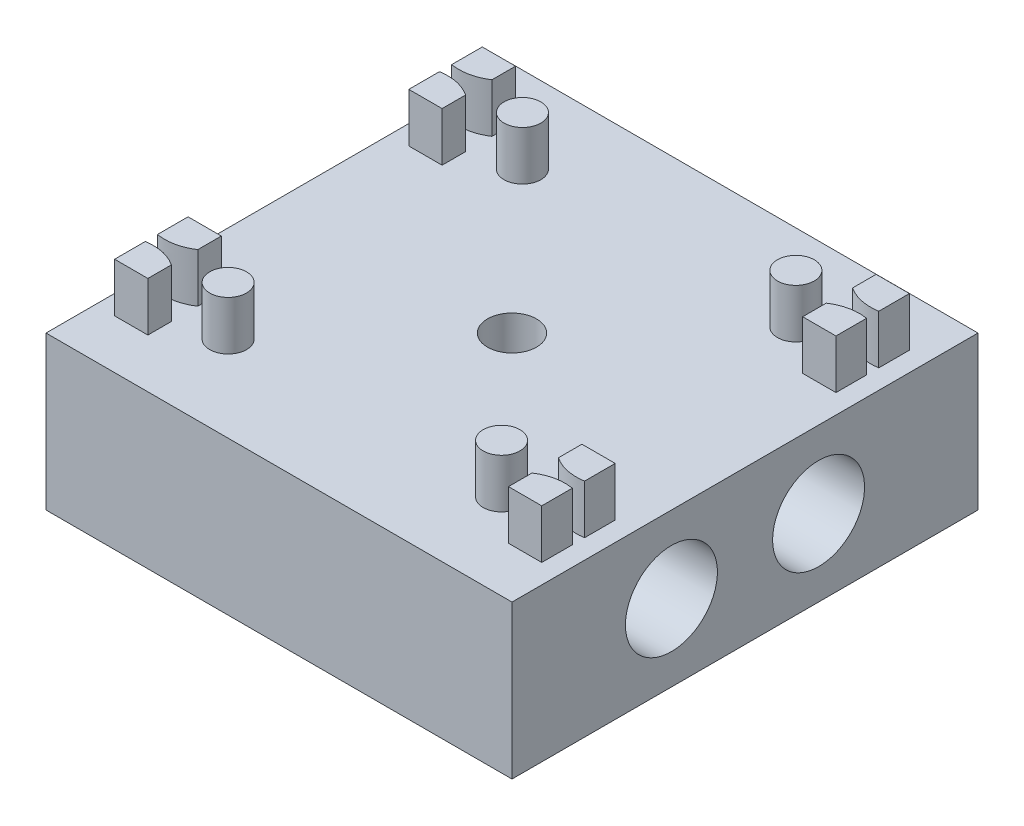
ISO-10303-21;
HEADER;
FILE_DESCRIPTION(('STEP AP214'),'2;1');
FILE_NAME('part.step','',(''),(''),'','','');
FILE_SCHEMA(('AUTOMOTIVE_DESIGN { 1 0 10303 214 1 1 1 1 }'));
ENDSEC;
DATA;
#1=APPLICATION_CONTEXT('core data for automotive mechanical design processes');
#2=APPLICATION_PROTOCOL_DEFINITION('international standard','automotive_design',2000,#1);
#3=PRODUCT_CONTEXT('',#1,'mechanical');
#4=PRODUCT('Part','Part','',(#3));
#5=PRODUCT_RELATED_PRODUCT_CATEGORY('part','',(#4));
#6=PRODUCT_DEFINITION_FORMATION('','',#4);
#7=PRODUCT_DEFINITION_CONTEXT('part definition',#1,'design');
#8=PRODUCT_DEFINITION('design','',#6,#7);
#9=PRODUCT_DEFINITION_SHAPE('','',#8);
#10=(LENGTH_UNIT() NAMED_UNIT(*) SI_UNIT(.MILLI.,.METRE.));
#11=(NAMED_UNIT(*) PLANE_ANGLE_UNIT() SI_UNIT($,.RADIAN.));
#12=(NAMED_UNIT(*) SI_UNIT($,.STERADIAN.) SOLID_ANGLE_UNIT());
#13=UNCERTAINTY_MEASURE_WITH_UNIT(LENGTH_MEASURE(1.E-05),#10,'distance_accuracy_value','');
#14=(GEOMETRIC_REPRESENTATION_CONTEXT(3) GLOBAL_UNCERTAINTY_ASSIGNED_CONTEXT((#13)) GLOBAL_UNIT_ASSIGNED_CONTEXT((#10,
#11,#12)) REPRESENTATION_CONTEXT('',''));
#15=CARTESIAN_POINT('',(0.,0.,0.));
#16=DIRECTION('',(0.,0.,1.));
#17=DIRECTION('',(1.,0.,0.));
#18=AXIS2_PLACEMENT_3D('',#15,#16,#17);
#19=CARTESIAN_POINT('',(0.,25.,0.));
#20=DIRECTION('',(0.,1.,0.));
#21=DIRECTION('',(0.,0.,1.));
#22=AXIS2_PLACEMENT_3D('',#19,#20,#21);
#23=PLANE('',#22);
#24=CARTESIAN_POINT('',(-9.29722289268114,25.,47.));
#25=DIRECTION('',(0.,1.,0.));
#26=DIRECTION('',(0.,0.,-1.));
#27=AXIS2_PLACEMENT_3D('',#24,#25,#26);
#28=CIRCLE('',#27,3.);
#29=CARTESIAN_POINT('',(-9.29722289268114,25.,44.));
#30=VERTEX_POINT('',#29);
#31=EDGE_CURVE('E1283',#30,#30,#28,.T.);
#32=ORIENTED_EDGE('',*,*,#31,.F.);
#33=EDGE_LOOP('',(#32));
#34=FACE_BOUND('',#33,.T.);
#35=CARTESIAN_POINT('',(35.2972228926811,25.,47.));
#36=DIRECTION('',(0.,1.,0.));
#37=DIRECTION('',(0.,0.,1.));
#38=AXIS2_PLACEMENT_3D('',#35,#36,#37);
#39=CIRCLE('',#38,3.);
#40=CARTESIAN_POINT('',(35.2972228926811,25.,50.));
#41=VERTEX_POINT('',#40);
#42=EDGE_CURVE('E717',#41,#41,#39,.T.);
#43=ORIENTED_EDGE('',*,*,#42,.F.);
#44=EDGE_LOOP('',(#43));
#45=FACE_BOUND('',#44,.T.);
#46=CARTESIAN_POINT('',(35.2972228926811,25.,-1.00000000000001));
#47=DIRECTION('',(0.,1.,0.));
#48=DIRECTION('',(0.,0.,-1.));
#49=AXIS2_PLACEMENT_3D('',#46,#47,#48);
#50=CIRCLE('',#49,3.);
#51=CARTESIAN_POINT('',(35.2972228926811,25.,-4.00000000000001));
#52=VERTEX_POINT('',#51);
#53=EDGE_CURVE('E448',#52,#52,#50,.T.);
#54=ORIENTED_EDGE('',*,*,#53,.F.);
#55=EDGE_LOOP('',(#54));
#56=FACE_BOUND('',#55,.T.);
#57=CARTESIAN_POINT('',(-9.29722289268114,25.,-1.));
#58=DIRECTION('',(0.,1.,0.));
#59=DIRECTION('',(0.,0.,1.));
#60=AXIS2_PLACEMENT_3D('',#57,#58,#59);
#61=CIRCLE('',#60,3.);
#62=CARTESIAN_POINT('',(-9.29722289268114,25.,2.));
#63=VERTEX_POINT('',#62);
#64=EDGE_CURVE('E564',#63,#63,#61,.T.);
#65=ORIENTED_EDGE('',*,*,#64,.F.);
#66=EDGE_LOOP('',(#65));
#67=FACE_BOUND('',#66,.T.);
#68=DIRECTION('',(0.,0.,1.));
#69=VECTOR('',#68,1.);
#70=CARTESIAN_POINT('',(-25.,25.,-15.));
#71=LINE('',#70,#69);
#72=CARTESIAN_POINT('',(-25.,25.,-15.));
#73=VERTEX_POINT('',#72);
#74=CARTESIAN_POINT('',(-25.,25.,61.));
#75=VERTEX_POINT('',#74);
#76=EDGE_CURVE('E636',#73,#75,#71,.T.);
#77=ORIENTED_EDGE('',*,*,#76,.T.);
#78=DIRECTION('',(1.,0.,0.));
#79=VECTOR('',#78,1.);
#80=CARTESIAN_POINT('',(-25.,25.,61.));
#81=LINE('',#80,#79);
#82=CARTESIAN_POINT('',(51.,25.,61.));
#83=VERTEX_POINT('',#82);
#84=EDGE_CURVE('E650',#75,#83,#81,.T.);
#85=ORIENTED_EDGE('',*,*,#84,.T.);
#86=DIRECTION('',(0.,0.,-1.));
#87=VECTOR('',#86,1.);
#88=CARTESIAN_POINT('',(51.,25.,-15.));
#89=LINE('',#88,#87);
#90=CARTESIAN_POINT('',(51.,25.,-15.));
#91=VERTEX_POINT('',#90);
#92=EDGE_CURVE('E630',#83,#91,#89,.T.);
#93=ORIENTED_EDGE('',*,*,#92,.T.);
#94=DIRECTION('',(-1.,0.,0.));
#95=VECTOR('',#94,1.);
#96=CARTESIAN_POINT('',(-25.,25.,-15.));
#97=LINE('',#96,#95);
#98=EDGE_CURVE('E643',#91,#73,#97,.T.);
#99=ORIENTED_EDGE('',*,*,#98,.T.);
#100=EDGE_LOOP('',(#77,#85,#93,#99));
#101=FACE_BOUND('',#100,.T.);
#102=CARTESIAN_POINT('',(13.,25.,23.));
#103=DIRECTION('',(0.,1.,0.));
#104=DIRECTION('',(0.,0.,1.));
#105=AXIS2_PLACEMENT_3D('',#102,#103,#104);
#106=CIRCLE('',#105,4.);
#107=CARTESIAN_POINT('',(13.,25.,27.));
#108=VERTEX_POINT('',#107);
#109=EDGE_CURVE('E653',#108,#108,#106,.T.);
#110=ORIENTED_EDGE('',*,*,#109,.F.);
#111=EDGE_LOOP('',(#110));
#112=FACE_BOUND('',#111,.T.);
#113=DIRECTION('',(0.,0.,1.));
#114=VECTOR('',#113,1.);
#115=CARTESIAN_POINT('',(42.4041910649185,25.,4.99817159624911));
#116=LINE('',#115,#114);
#117=CARTESIAN_POINT('',(42.4041910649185,25.,1.15847396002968));
#118=VERTEX_POINT('',#117);
#119=CARTESIAN_POINT('',(42.4041910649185,25.,4.99817159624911));
#120=VERTEX_POINT('',#119);
#121=EDGE_CURVE('E671',#118,#120,#116,.T.);
#122=ORIENTED_EDGE('',*,*,#121,.F.);
#123=CARTESIAN_POINT('',(47.831300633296,25.,-0.00182840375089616));
#124=CARTESIAN_POINT('',(44.8465849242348,25.,-0.441918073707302));
#125=CARTESIAN_POINT('',(42.4041910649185,25.,1.15847396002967));
#126=B_SPLINE_CURVE_WITH_KNOTS('',2,(#123,#124,#125),.UNSPECIFIED.,.F.,.F.,(3,3),(0.,1.),.UNSPECIFIED.);
#127=CARTESIAN_POINT('',(47.831300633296,25.,-0.00182840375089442));
#128=VERTEX_POINT('',#127);
#129=EDGE_CURVE('E568',#128,#118,#126,.T.);
#130=ORIENTED_EDGE('',*,*,#129,.F.);
#131=DIRECTION('',(0.,0.,-1.));
#132=VECTOR('',#131,1.);
#133=CARTESIAN_POINT('',(47.831300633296,25.,4.99817159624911));
#134=LINE('',#133,#132);
#135=CARTESIAN_POINT('',(47.831300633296,25.,4.99817159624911));
#136=VERTEX_POINT('',#135);
#137=EDGE_CURVE('E578',#136,#128,#134,.T.);
#138=ORIENTED_EDGE('',*,*,#137,.F.);
#139=DIRECTION('',(1.,0.,0.));
#140=VECTOR('',#139,1.);
#141=CARTESIAN_POINT('',(47.831300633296,25.,4.99817159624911));
#142=LINE('',#141,#140);
#143=EDGE_CURVE('E831',#120,#136,#142,.T.);
#144=ORIENTED_EDGE('',*,*,#143,.F.);
#145=EDGE_LOOP('',(#122,#130,#138,#144));
#146=FACE_BOUND('',#145,.T.);
#147=CARTESIAN_POINT('',(-21.831300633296,25.,-1.98182840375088));
#148=CARTESIAN_POINT('',(-18.8465849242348,25.,-1.54173873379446));
#149=CARTESIAN_POINT('',(-16.4041910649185,25.,-3.14213076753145));
#150=B_SPLINE_CURVE_WITH_KNOTS('',2,(#147,#148,#149),.UNSPECIFIED.,.F.,.F.,(3,3),(0.,1.),.UNSPECIFIED.);
#151=CARTESIAN_POINT('',(-21.831300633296,25.,-1.98182840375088));
#152=VERTEX_POINT('',#151);
#153=CARTESIAN_POINT('',(-16.4041910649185,25.,-3.14213076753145));
#154=VERTEX_POINT('',#153);
#155=EDGE_CURVE('E542',#152,#154,#150,.T.);
#156=ORIENTED_EDGE('',*,*,#155,.F.);
#157=DIRECTION('',(0.,0.,1.));
#158=VECTOR('',#157,1.);
#159=CARTESIAN_POINT('',(-21.831300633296,25.,-6.98182840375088));
#160=LINE('',#159,#158);
#161=CARTESIAN_POINT('',(-21.831300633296,25.,-6.98182840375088));
#162=VERTEX_POINT('',#161);
#163=EDGE_CURVE('E539',#162,#152,#160,.T.);
#164=ORIENTED_EDGE('',*,*,#163,.F.);
#165=DIRECTION('',(-1.,0.,0.));
#166=VECTOR('',#165,1.);
#167=CARTESIAN_POINT('',(-21.831300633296,25.,-6.98182840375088));
#168=LINE('',#167,#166);
#169=CARTESIAN_POINT('',(-16.4041910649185,25.,-6.98182840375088));
#170=VERTEX_POINT('',#169);
#171=EDGE_CURVE('E553',#170,#162,#168,.T.);
#172=ORIENTED_EDGE('',*,*,#171,.F.);
#173=DIRECTION('',(0.,0.,-1.));
#174=VECTOR('',#173,1.);
#175=CARTESIAN_POINT('',(-16.4041910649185,25.,-6.98182840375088));
#176=LINE('',#175,#174);
#177=EDGE_CURVE('E547',#154,#170,#176,.T.);
#178=ORIENTED_EDGE('',*,*,#177,.F.);
#179=EDGE_LOOP('',(#156,#164,#172,#178));
#180=FACE_BOUND('',#179,.T.);
#181=DIRECTION('',(0.,0.,1.));
#182=VECTOR('',#181,1.);
#183=CARTESIAN_POINT('',(-21.831300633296,25.,4.99817159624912));
#184=LINE('',#183,#182);
#185=CARTESIAN_POINT('',(-21.831300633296,25.,-0.00182840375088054));
#186=VERTEX_POINT('',#185);
#187=CARTESIAN_POINT('',(-21.831300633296,25.,4.99817159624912));
#188=VERTEX_POINT('',#187);
#189=EDGE_CURVE('E680',#186,#188,#184,.T.);
#190=ORIENTED_EDGE('',*,*,#189,.F.);
#191=CARTESIAN_POINT('',(-16.4041910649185,25.,1.15847396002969));
#192=CARTESIAN_POINT('',(-18.8465849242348,25.,-0.441918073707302));
#193=CARTESIAN_POINT('',(-21.831300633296,25.,-0.00182840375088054));
#194=B_SPLINE_CURVE_WITH_KNOTS('',2,(#191,#192,#193),.UNSPECIFIED.,.F.,.F.,(3,3),(0.,1.),.UNSPECIFIED.);
#195=CARTESIAN_POINT('',(-16.4041910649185,25.,1.15847396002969));
#196=VERTEX_POINT('',#195);
#197=EDGE_CURVE('E483',#196,#186,#194,.T.);
#198=ORIENTED_EDGE('',*,*,#197,.F.);
#199=DIRECTION('',(0.,0.,-1.));
#200=VECTOR('',#199,1.);
#201=CARTESIAN_POINT('',(-16.4041910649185,25.,4.99817159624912));
#202=LINE('',#201,#200);
#203=CARTESIAN_POINT('',(-16.4041910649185,25.,4.99817159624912));
#204=VERTEX_POINT('',#203);
#205=EDGE_CURVE('E491',#204,#196,#202,.T.);
#206=ORIENTED_EDGE('',*,*,#205,.F.);
#207=DIRECTION('',(1.,0.,0.));
#208=VECTOR('',#207,1.);
#209=CARTESIAN_POINT('',(-21.831300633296,25.,4.99817159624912));
#210=LINE('',#209,#208);
#211=EDGE_CURVE('E1206',#188,#204,#210,.T.);
#212=ORIENTED_EDGE('',*,*,#211,.F.);
#213=EDGE_LOOP('',(#190,#198,#206,#212));
#214=FACE_BOUND('',#213,.T.);
#215=DIRECTION('',(0.,0.,-1.));
#216=VECTOR('',#215,1.);
#217=CARTESIAN_POINT('',(47.831300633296,25.,-6.98182840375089));
#218=LINE('',#217,#216);
#219=CARTESIAN_POINT('',(47.831300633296,25.,-1.98182840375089));
#220=VERTEX_POINT('',#219);
#221=CARTESIAN_POINT('',(47.831300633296,25.,-6.98182840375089));
#222=VERTEX_POINT('',#221);
#223=EDGE_CURVE('E464',#220,#222,#218,.T.);
#224=ORIENTED_EDGE('',*,*,#223,.F.);
#225=CARTESIAN_POINT('',(42.4041910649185,25.,-3.14213076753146));
#226=CARTESIAN_POINT('',(44.8465849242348,25.,-1.54173873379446));
#227=CARTESIAN_POINT('',(47.831300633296,25.,-1.9818284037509));
#228=B_SPLINE_CURVE_WITH_KNOTS('',2,(#225,#226,#227),.UNSPECIFIED.,.F.,.F.,(3,3),(0.,1.),.UNSPECIFIED.);
#229=CARTESIAN_POINT('',(42.4041910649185,25.,-3.14213076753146));
#230=VERTEX_POINT('',#229);
#231=EDGE_CURVE('E459',#230,#220,#228,.T.);
#232=ORIENTED_EDGE('',*,*,#231,.F.);
#233=DIRECTION('',(0.,0.,1.));
#234=VECTOR('',#233,1.);
#235=CARTESIAN_POINT('',(42.4041910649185,25.,-6.98182840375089));
#236=LINE('',#235,#234);
#237=CARTESIAN_POINT('',(42.4041910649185,25.,-6.98182840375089));
#238=VERTEX_POINT('',#237);
#239=EDGE_CURVE('E447',#238,#230,#236,.T.);
#240=ORIENTED_EDGE('',*,*,#239,.F.);
#241=DIRECTION('',(-1.,0.,0.));
#242=VECTOR('',#241,1.);
#243=CARTESIAN_POINT('',(47.831300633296,25.,-6.98182840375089));
#244=LINE('',#243,#242);
#245=EDGE_CURVE('E470',#222,#238,#244,.T.);
#246=ORIENTED_EDGE('',*,*,#245,.F.);
#247=EDGE_LOOP('',(#224,#232,#240,#246));
#248=FACE_BOUND('',#247,.T.);
#249=DIRECTION('',(0.,0.,-1.));
#250=VECTOR('',#249,1.);
#251=CARTESIAN_POINT('',(47.831300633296,25.,52.9818284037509));
#252=LINE('',#251,#250);
#253=CARTESIAN_POINT('',(47.831300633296,25.,52.9818284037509));
#254=VERTEX_POINT('',#253);
#255=CARTESIAN_POINT('',(47.831300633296,25.,47.9818284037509));
#256=VERTEX_POINT('',#255);
#257=EDGE_CURVE('E689',#254,#256,#252,.T.);
#258=ORIENTED_EDGE('',*,*,#257,.F.);
#259=DIRECTION('',(1.,0.,0.));
#260=VECTOR('',#259,1.);
#261=CARTESIAN_POINT('',(47.831300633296,25.,52.9818284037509));
#262=LINE('',#261,#260);
#263=CARTESIAN_POINT('',(42.4041910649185,25.,52.9818284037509));
#264=VERTEX_POINT('',#263);
#265=EDGE_CURVE('E375',#264,#254,#262,.T.);
#266=ORIENTED_EDGE('',*,*,#265,.F.);
#267=DIRECTION('',(0.,0.,1.));
#268=VECTOR('',#267,1.);
#269=CARTESIAN_POINT('',(42.4041910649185,25.,52.9818284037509));
#270=LINE('',#269,#268);
#271=CARTESIAN_POINT('',(42.4041910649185,25.,49.1421307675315));
#272=VERTEX_POINT('',#271);
#273=EDGE_CURVE('E380',#272,#264,#270,.T.);
#274=ORIENTED_EDGE('',*,*,#273,.F.);
#275=CARTESIAN_POINT('',(47.831300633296,25.,47.9818284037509));
#276=CARTESIAN_POINT('',(44.8465849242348,25.,47.5417387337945));
#277=CARTESIAN_POINT('',(42.4041910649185,25.,49.1421307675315));
#278=B_SPLINE_CURVE_WITH_KNOTS('',2,(#275,#276,#277),.UNSPECIFIED.,.F.,.F.,(3,3),(0.,1.),.UNSPECIFIED.);
#279=EDGE_CURVE('E1312',#256,#272,#278,.T.);
#280=ORIENTED_EDGE('',*,*,#279,.F.);
#281=EDGE_LOOP('',(#258,#266,#274,#280));
#282=FACE_BOUND('',#281,.T.);
#283=DIRECTION('',(0.,0.,1.));
#284=VECTOR('',#283,1.);
#285=CARTESIAN_POINT('',(42.4041910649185,25.,41.0018284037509));
#286=LINE('',#285,#284);
#287=CARTESIAN_POINT('',(42.4041910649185,25.,41.0018284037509));
#288=VERTEX_POINT('',#287);
#289=CARTESIAN_POINT('',(42.4041910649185,25.,44.8415260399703));
#290=VERTEX_POINT('',#289);
#291=EDGE_CURVE('E352',#288,#290,#286,.T.);
#292=ORIENTED_EDGE('',*,*,#291,.F.);
#293=DIRECTION('',(-1.,0.,0.));
#294=VECTOR('',#293,1.);
#295=CARTESIAN_POINT('',(47.831300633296,25.,41.0018284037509));
#296=LINE('',#295,#294);
#297=CARTESIAN_POINT('',(47.831300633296,25.,41.0018284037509));
#298=VERTEX_POINT('',#297);
#299=EDGE_CURVE('E349',#298,#288,#296,.T.);
#300=ORIENTED_EDGE('',*,*,#299,.F.);
#301=DIRECTION('',(0.,0.,-1.));
#302=VECTOR('',#301,1.);
#303=CARTESIAN_POINT('',(47.831300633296,25.,41.0018284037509));
#304=LINE('',#303,#302);
#305=CARTESIAN_POINT('',(47.831300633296,25.,46.0018284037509));
#306=VERTEX_POINT('',#305);
#307=EDGE_CURVE('E360',#306,#298,#304,.T.);
#308=ORIENTED_EDGE('',*,*,#307,.F.);
#309=CARTESIAN_POINT('',(42.4041910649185,25.,44.8415260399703));
#310=CARTESIAN_POINT('',(44.8465849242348,25.,46.4419180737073));
#311=CARTESIAN_POINT('',(47.831300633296,25.,46.0018284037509));
#312=B_SPLINE_CURVE_WITH_KNOTS('',2,(#309,#310,#311),.UNSPECIFIED.,.F.,.F.,(3,3),(0.,1.),.UNSPECIFIED.);
#313=EDGE_CURVE('E355',#290,#306,#312,.T.);
#314=ORIENTED_EDGE('',*,*,#313,.F.);
#315=EDGE_LOOP('',(#292,#300,#308,#314));
#316=FACE_BOUND('',#315,.T.);
#317=DIRECTION('',(0.,0.,-1.));
#318=VECTOR('',#317,1.);
#319=CARTESIAN_POINT('',(-16.4041910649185,25.,41.0018284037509));
#320=LINE('',#319,#318);
#321=CARTESIAN_POINT('',(-16.4041910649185,25.,44.8415260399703));
#322=VERTEX_POINT('',#321);
#323=CARTESIAN_POINT('',(-16.4041910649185,25.,41.0018284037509));
#324=VERTEX_POINT('',#323);
#325=EDGE_CURVE('E295',#322,#324,#320,.T.);
#326=ORIENTED_EDGE('',*,*,#325,.F.);
#327=CARTESIAN_POINT('',(-21.831300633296,25.,46.0018284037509));
#328=CARTESIAN_POINT('',(-18.8465849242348,25.,46.4419180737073));
#329=CARTESIAN_POINT('',(-16.4041910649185,25.,44.8415260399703));
#330=B_SPLINE_CURVE_WITH_KNOTS('',2,(#327,#328,#329),.UNSPECIFIED.,.F.,.F.,(3,3),(0.,1.),.UNSPECIFIED.);
#331=CARTESIAN_POINT('',(-21.831300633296,25.,46.0018284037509));
#332=VERTEX_POINT('',#331);
#333=EDGE_CURVE('E292',#332,#322,#330,.T.);
#334=ORIENTED_EDGE('',*,*,#333,.F.);
#335=DIRECTION('',(0.,0.,1.));
#336=VECTOR('',#335,1.);
#337=CARTESIAN_POINT('',(-21.831300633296,25.,41.0018284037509));
#338=LINE('',#337,#336);
#339=CARTESIAN_POINT('',(-21.831300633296,25.,41.0018284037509));
#340=VERTEX_POINT('',#339);
#341=EDGE_CURVE('E307',#340,#332,#338,.T.);
#342=ORIENTED_EDGE('',*,*,#341,.F.);
#343=DIRECTION('',(-1.,0.,0.));
#344=VECTOR('',#343,1.);
#345=CARTESIAN_POINT('',(-21.831300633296,25.,41.0018284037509));
#346=LINE('',#345,#344);
#347=EDGE_CURVE('E741',#324,#340,#346,.T.);
#348=ORIENTED_EDGE('',*,*,#347,.F.);
#349=EDGE_LOOP('',(#326,#334,#342,#348));
#350=FACE_BOUND('',#349,.T.);
#351=DIRECTION('',(0.,0.,1.));
#352=VECTOR('',#351,1.);
#353=CARTESIAN_POINT('',(-21.831300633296,25.,52.9818284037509));
#354=LINE('',#353,#352);
#355=CARTESIAN_POINT('',(-21.831300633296,25.,47.9818284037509));
#356=VERTEX_POINT('',#355);
#357=CARTESIAN_POINT('',(-21.831300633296,25.,52.9818284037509));
#358=VERTEX_POINT('',#357);
#359=EDGE_CURVE('E699',#356,#358,#354,.T.);
#360=ORIENTED_EDGE('',*,*,#359,.F.);
#361=CARTESIAN_POINT('',(-16.4041910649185,25.,49.1421307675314));
#362=CARTESIAN_POINT('',(-18.8465849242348,25.,47.5417387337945));
#363=CARTESIAN_POINT('',(-21.831300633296,25.,47.9818284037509));
#364=B_SPLINE_CURVE_WITH_KNOTS('',2,(#361,#362,#363),.UNSPECIFIED.,.F.,.F.,(3,3),(0.,1.),.UNSPECIFIED.);
#365=CARTESIAN_POINT('',(-16.4041910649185,25.,49.1421307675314));
#366=VERTEX_POINT('',#365);
#367=EDGE_CURVE('E290',#366,#356,#364,.T.);
#368=ORIENTED_EDGE('',*,*,#367,.F.);
#369=DIRECTION('',(0.,0.,-1.));
#370=VECTOR('',#369,1.);
#371=CARTESIAN_POINT('',(-16.4041910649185,25.,52.9818284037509));
#372=LINE('',#371,#370);
#373=CARTESIAN_POINT('',(-16.4041910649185,25.,52.9818284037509));
#374=VERTEX_POINT('',#373);
#375=EDGE_CURVE('E286',#374,#366,#372,.T.);
#376=ORIENTED_EDGE('',*,*,#375,.F.);
#377=DIRECTION('',(1.,0.,0.));
#378=VECTOR('',#377,1.);
#379=CARTESIAN_POINT('',(-21.831300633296,25.,52.9818284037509));
#380=LINE('',#379,#378);
#381=EDGE_CURVE('E701',#358,#374,#380,.T.);
#382=ORIENTED_EDGE('',*,*,#381,.F.);
#383=EDGE_LOOP('',(#360,#368,#376,#382));
#384=FACE_BOUND('',#383,.T.);
#385=ADVANCED_FACE('F33',(#34,#45,#56,#67,#101,#112,#146,#180,#214,#248,#282,#316,#350,#384),
#23,.T.);
#386=CARTESIAN_POINT('',(0.,0.,0.));
#387=DIRECTION('',(0.,1.,0.));
#388=DIRECTION('',(0.,0.,1.));
#389=AXIS2_PLACEMENT_3D('',#386,#387,#388);
#390=PLANE('',#389);
#391=DIRECTION('',(0.,0.,1.));
#392=VECTOR('',#391,1.);
#393=CARTESIAN_POINT('',(-25.,0.,-15.));
#394=LINE('',#393,#392);
#395=CARTESIAN_POINT('',(-25.,0.,-15.));
#396=VERTEX_POINT('',#395);
#397=CARTESIAN_POINT('',(-25.,0.,61.));
#398=VERTEX_POINT('',#397);
#399=EDGE_CURVE('E625',#396,#398,#394,.T.);
#400=ORIENTED_EDGE('',*,*,#399,.F.);
#401=DIRECTION('',(-1.,0.,0.));
#402=VECTOR('',#401,1.);
#403=CARTESIAN_POINT('',(-25.,0.,-15.));
#404=LINE('',#403,#402);
#405=CARTESIAN_POINT('',(51.,0.,-15.));
#406=VERTEX_POINT('',#405);
#407=EDGE_CURVE('E634',#406,#396,#404,.T.);
#408=ORIENTED_EDGE('',*,*,#407,.F.);
#409=DIRECTION('',(0.,0.,-1.));
#410=VECTOR('',#409,1.);
#411=CARTESIAN_POINT('',(51.,0.,-15.));
#412=LINE('',#411,#410);
#413=CARTESIAN_POINT('',(51.,0.,61.));
#414=VERTEX_POINT('',#413);
#415=EDGE_CURVE('E624',#414,#406,#412,.T.);
#416=ORIENTED_EDGE('',*,*,#415,.F.);
#417=DIRECTION('',(1.,0.,0.));
#418=VECTOR('',#417,1.);
#419=CARTESIAN_POINT('',(-25.,0.,61.));
#420=LINE('',#419,#418);
#421=EDGE_CURVE('E617',#398,#414,#420,.T.);
#422=ORIENTED_EDGE('',*,*,#421,.F.);
#423=EDGE_LOOP('',(#400,#408,#416,#422));
#424=FACE_BOUND('',#423,.T.);
#425=CARTESIAN_POINT('',(13.,0.,23.));
#426=DIRECTION('',(0.,1.,0.));
#427=DIRECTION('',(0.,0.,1.));
#428=AXIS2_PLACEMENT_3D('',#425,#426,#427);
#429=CIRCLE('',#428,4.);
#430=CARTESIAN_POINT('',(13.,0.,27.));
#431=VERTEX_POINT('',#430);
#432=EDGE_CURVE('E656',#431,#431,#429,.T.);
#433=ORIENTED_EDGE('',*,*,#432,.T.);
#434=EDGE_LOOP('',(#433));
#435=FACE_BOUND('',#434,.T.);
#436=ADVANCED_FACE('F598',(#424,#435),#390,.F.);
#437=CARTESIAN_POINT('',(-25.,25.,-15.));
#438=DIRECTION('',(1.,0.,0.));
#439=DIRECTION('',(0.,0.,-1.));
#440=AXIS2_PLACEMENT_3D('',#437,#438,#439);
#441=PLANE('',#440);
#442=CARTESIAN_POINT('',(-25.,12.5,35.));
#443=DIRECTION('',(-1.,0.,0.));
#444=DIRECTION('',(0.,0.,1.));
#445=AXIS2_PLACEMENT_3D('',#442,#443,#444);
#446=CIRCLE('',#445,7.5);
#447=CARTESIAN_POINT('',(-25.,12.5,42.5));
#448=VERTEX_POINT('',#447);
#449=EDGE_CURVE('E1296',#448,#448,#446,.T.);
#450=ORIENTED_EDGE('',*,*,#449,.F.);
#451=EDGE_LOOP('',(#450));
#452=FACE_BOUND('',#451,.T.);
#453=CARTESIAN_POINT('',(-25.,12.5,11.));
#454=DIRECTION('',(-1.,0.,0.));
#455=DIRECTION('',(0.,0.,1.));
#456=AXIS2_PLACEMENT_3D('',#453,#454,#455);
#457=CIRCLE('',#456,7.5);
#458=CARTESIAN_POINT('',(-25.,12.5,18.5));
#459=VERTEX_POINT('',#458);
#460=EDGE_CURVE('E1290',#459,#459,#457,.T.);
#461=ORIENTED_EDGE('',*,*,#460,.F.);
#462=EDGE_LOOP('',(#461));
#463=FACE_BOUND('',#462,.T.);
#464=ORIENTED_EDGE('',*,*,#399,.T.);
#465=DIRECTION('',(0.,-1.,0.));
#466=VECTOR('',#465,1.);
#467=CARTESIAN_POINT('',(-25.,25.,61.));
#468=LINE('',#467,#466);
#469=EDGE_CURVE('E11',#75,#398,#468,.T.);
#470=ORIENTED_EDGE('',*,*,#469,.F.);
#471=ORIENTED_EDGE('',*,*,#76,.F.);
#472=DIRECTION('',(0.,-1.,0.));
#473=VECTOR('',#472,1.);
#474=CARTESIAN_POINT('',(-25.,25.,-15.));
#475=LINE('',#474,#473);
#476=EDGE_CURVE('E640',#73,#396,#475,.T.);
#477=ORIENTED_EDGE('',*,*,#476,.T.);
#478=EDGE_LOOP('',(#464,#470,#471,#477));
#479=FACE_BOUND('',#478,.T.);
#480=ADVANCED_FACE('F35',(#452,#463,#479),#441,.F.);
#481=CARTESIAN_POINT('',(-25.,25.,61.));
#482=DIRECTION('',(0.,0.,-1.));
#483=DIRECTION('',(-1.,0.,0.));
#484=AXIS2_PLACEMENT_3D('',#481,#482,#483);
#485=PLANE('',#484);
#486=ORIENTED_EDGE('',*,*,#421,.T.);
#487=DIRECTION('',(0.,-1.,0.));
#488=VECTOR('',#487,1.);
#489=CARTESIAN_POINT('',(51.,25.,61.));
#490=LINE('',#489,#488);
#491=EDGE_CURVE('E41',#83,#414,#490,.T.);
#492=ORIENTED_EDGE('',*,*,#491,.F.);
#493=ORIENTED_EDGE('',*,*,#84,.F.);
#494=ORIENTED_EDGE('',*,*,#469,.T.);
#495=EDGE_LOOP('',(#486,#492,#493,#494));
#496=FACE_BOUND('',#495,.T.);
#497=ADVANCED_FACE('F608',(#496),#485,.F.);
#498=CARTESIAN_POINT('',(51.,25.,-15.));
#499=DIRECTION('',(-1.,0.,0.));
#500=DIRECTION('',(0.,0.,1.));
#501=AXIS2_PLACEMENT_3D('',#498,#499,#500);
#502=PLANE('',#501);
#503=CARTESIAN_POINT('',(51.,12.5,35.));
#504=DIRECTION('',(-1.,0.,0.));
#505=DIRECTION('',(0.,0.,1.));
#506=AXIS2_PLACEMENT_3D('',#503,#504,#505);
#507=CIRCLE('',#506,7.5);
#508=CARTESIAN_POINT('',(51.,12.5,42.5));
#509=VERTEX_POINT('',#508);
#510=EDGE_CURVE('E1293',#509,#509,#507,.T.);
#511=ORIENTED_EDGE('',*,*,#510,.T.);
#512=EDGE_LOOP('',(#511));
#513=FACE_BOUND('',#512,.T.);
#514=CARTESIAN_POINT('',(51.,12.5,11.));
#515=DIRECTION('',(-1.,0.,0.));
#516=DIRECTION('',(0.,0.,1.));
#517=AXIS2_PLACEMENT_3D('',#514,#515,#516);
#518=CIRCLE('',#517,7.5);
#519=CARTESIAN_POINT('',(51.,12.5,18.5));
#520=VERTEX_POINT('',#519);
#521=EDGE_CURVE('E1287',#520,#520,#518,.T.);
#522=ORIENTED_EDGE('',*,*,#521,.T.);
#523=EDGE_LOOP('',(#522));
#524=FACE_BOUND('',#523,.T.);
#525=ORIENTED_EDGE('',*,*,#415,.T.);
#526=DIRECTION('',(0.,-1.,0.));
#527=VECTOR('',#526,1.);
#528=CARTESIAN_POINT('',(51.,25.,-15.));
#529=LINE('',#528,#527);
#530=EDGE_CURVE('E631',#91,#406,#529,.T.);
#531=ORIENTED_EDGE('',*,*,#530,.F.);
#532=ORIENTED_EDGE('',*,*,#92,.F.);
#533=ORIENTED_EDGE('',*,*,#491,.T.);
#534=EDGE_LOOP('',(#525,#531,#532,#533));
#535=FACE_BOUND('',#534,.T.);
#536=ADVANCED_FACE('F605',(#513,#524,#535),#502,.F.);
#537=CARTESIAN_POINT('',(-25.,25.,-15.));
#538=DIRECTION('',(0.,0.,1.));
#539=DIRECTION('',(1.,0.,0.));
#540=AXIS2_PLACEMENT_3D('',#537,#538,#539);
#541=PLANE('',#540);
#542=ORIENTED_EDGE('',*,*,#407,.T.);
#543=ORIENTED_EDGE('',*,*,#476,.F.);
#544=ORIENTED_EDGE('',*,*,#98,.F.);
#545=ORIENTED_EDGE('',*,*,#530,.T.);
#546=EDGE_LOOP('',(#542,#543,#544,#545));
#547=FACE_BOUND('',#546,.T.);
#548=ADVANCED_FACE('F594',(#547),#541,.F.);
#549=CARTESIAN_POINT('',(13.,25.,23.));
#550=DIRECTION('',(0.,-1.,0.));
#551=DIRECTION('',(0.,0.,-1.));
#552=AXIS2_PLACEMENT_3D('',#549,#550,#551);
#553=CYLINDRICAL_SURFACE('',#552,4.);
#554=ORIENTED_EDGE('',*,*,#109,.T.);
#555=EDGE_LOOP('',(#554));
#556=FACE_BOUND('',#555,.T.);
#557=ORIENTED_EDGE('',*,*,#432,.F.);
#558=EDGE_LOOP('',(#557));
#559=FACE_BOUND('',#558,.T.);
#560=ADVANCED_FACE('F589',(#556,#559),#553,.F.);
#561=CARTESIAN_POINT('',(47.831300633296,33.,-0.00182840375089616));
#562=CARTESIAN_POINT('',(44.8465849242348,33.,-0.441918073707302));
#563=CARTESIAN_POINT('',(42.4041910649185,33.,1.15847396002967));
#564=B_SPLINE_CURVE_WITH_KNOTS('',2,(#561,#562,#563),.UNSPECIFIED.,.F.,.F.,(3,3),(0.,1.),.UNSPECIFIED.);
#565=DIRECTION('',(0.,-1.,0.));
#566=VECTOR('',#565,1.);
#567=SURFACE_OF_LINEAR_EXTRUSION('',#564,#566);
#568=ORIENTED_EDGE('',*,*,#129,.T.);
#569=DIRECTION('',(0.,-1.,0.));
#570=VECTOR('',#569,1.);
#571=CARTESIAN_POINT('',(42.4041910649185,33.,1.15847396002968));
#572=LINE('',#571,#570);
#573=CARTESIAN_POINT('',(42.4041910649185,33.,1.15847396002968));
#574=VERTEX_POINT('',#573);
#575=EDGE_CURVE('E660',#574,#118,#572,.T.);
#576=ORIENTED_EDGE('',*,*,#575,.F.);
#577=CARTESIAN_POINT('',(47.831300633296,33.,-0.00182840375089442));
#578=VERTEX_POINT('',#577);
#579=EDGE_CURVE('E571',#578,#574,#564,.T.);
#580=ORIENTED_EDGE('',*,*,#579,.F.);
#581=DIRECTION('',(0.,-1.,0.));
#582=VECTOR('',#581,1.);
#583=CARTESIAN_POINT('',(47.831300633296,33.,-0.00182840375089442));
#584=LINE('',#583,#582);
#585=EDGE_CURVE('E845',#578,#128,#584,.T.);
#586=ORIENTED_EDGE('',*,*,#585,.T.);
#587=EDGE_LOOP('',(#568,#576,#580,#586));
#588=FACE_BOUND('',#587,.T.);
#589=ADVANCED_FACE('F584',(#588),#567,.F.);
#590=CARTESIAN_POINT('',(42.4041910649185,33.,4.99817159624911));
#591=DIRECTION('',(1.,0.,0.));
#592=DIRECTION('',(0.,0.,-1.));
#593=AXIS2_PLACEMENT_3D('',#590,#591,#592);
#594=PLANE('',#593);
#595=ORIENTED_EDGE('',*,*,#121,.T.);
#596=DIRECTION('',(0.,-1.,0.));
#597=VECTOR('',#596,1.);
#598=CARTESIAN_POINT('',(42.4041910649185,33.,4.99817159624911));
#599=LINE('',#598,#597);
#600=CARTESIAN_POINT('',(42.4041910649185,33.,4.99817159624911));
#601=VERTEX_POINT('',#600);
#602=EDGE_CURVE('E837',#601,#120,#599,.T.);
#603=ORIENTED_EDGE('',*,*,#602,.F.);
#604=DIRECTION('',(0.,0.,1.));
#605=VECTOR('',#604,1.);
#606=CARTESIAN_POINT('',(42.4041910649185,33.,4.99817159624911));
#607=LINE('',#606,#605);
#608=EDGE_CURVE('E577',#574,#601,#607,.T.);
#609=ORIENTED_EDGE('',*,*,#608,.F.);
#610=ORIENTED_EDGE('',*,*,#575,.T.);
#611=EDGE_LOOP('',(#595,#603,#609,#610));
#612=FACE_BOUND('',#611,.T.);
#613=ADVANCED_FACE('F588',(#612),#594,.F.);
#614=CARTESIAN_POINT('',(47.831300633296,33.,4.99817159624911));
#615=DIRECTION('',(0.,0.,-1.));
#616=DIRECTION('',(-1.,0.,0.));
#617=AXIS2_PLACEMENT_3D('',#614,#615,#616);
#618=PLANE('',#617);
#619=ORIENTED_EDGE('',*,*,#143,.T.);
#620=DIRECTION('',(0.,-1.,0.));
#621=VECTOR('',#620,1.);
#622=CARTESIAN_POINT('',(47.831300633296,33.,4.99817159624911));
#623=LINE('',#622,#621);
#624=CARTESIAN_POINT('',(47.831300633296,33.,4.99817159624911));
#625=VERTEX_POINT('',#624);
#626=EDGE_CURVE('E834',#625,#136,#623,.T.);
#627=ORIENTED_EDGE('',*,*,#626,.F.);
#628=DIRECTION('',(1.,0.,0.));
#629=VECTOR('',#628,1.);
#630=CARTESIAN_POINT('',(47.831300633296,33.,4.99817159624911));
#631=LINE('',#630,#629);
#632=EDGE_CURVE('E857',#601,#625,#631,.T.);
#633=ORIENTED_EDGE('',*,*,#632,.F.);
#634=ORIENTED_EDGE('',*,*,#602,.T.);
#635=EDGE_LOOP('',(#619,#627,#633,#634));
#636=FACE_BOUND('',#635,.T.);
#637=ADVANCED_FACE('F820',(#636),#618,.F.);
#638=CARTESIAN_POINT('',(47.831300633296,33.,4.99817159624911));
#639=DIRECTION('',(-1.,0.,0.));
#640=DIRECTION('',(0.,0.,1.));
#641=AXIS2_PLACEMENT_3D('',#638,#639,#640);
#642=PLANE('',#641);
#643=ORIENTED_EDGE('',*,*,#137,.T.);
#644=ORIENTED_EDGE('',*,*,#585,.F.);
#645=DIRECTION('',(0.,0.,-1.));
#646=VECTOR('',#645,1.);
#647=CARTESIAN_POINT('',(47.831300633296,33.,4.99817159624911));
#648=LINE('',#647,#646);
#649=EDGE_CURVE('E847',#625,#578,#648,.T.);
#650=ORIENTED_EDGE('',*,*,#649,.F.);
#651=ORIENTED_EDGE('',*,*,#626,.T.);
#652=EDGE_LOOP('',(#643,#644,#650,#651));
#653=FACE_BOUND('',#652,.T.);
#654=ADVANCED_FACE('F814',(#653),#642,.F.);
#655=CARTESIAN_POINT('',(44.982165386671,33.,0.0682023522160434));
#656=DIRECTION('',(0.,-1.,0.));
#657=DIRECTION('',(0.,0.,-1.));
#658=AXIS2_PLACEMENT_3D('',#655,#656,#657);
#659=PLANE('',#658);
#660=ORIENTED_EDGE('',*,*,#579,.T.);
#661=ORIENTED_EDGE('',*,*,#608,.T.);
#662=ORIENTED_EDGE('',*,*,#632,.T.);
#663=ORIENTED_EDGE('',*,*,#649,.T.);
#664=EDGE_LOOP('',(#660,#661,#662,#663));
#665=FACE_BOUND('',#664,.T.);
#666=ADVANCED_FACE('F806',(#665),#659,.F.);
#667=CARTESIAN_POINT('',(-9.29722289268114,33.,-1.));
#668=DIRECTION('',(0.,-1.,0.));
#669=DIRECTION('',(0.,0.,-1.));
#670=AXIS2_PLACEMENT_3D('',#667,#668,#669);
#671=CYLINDRICAL_SURFACE('',#670,3.);
#672=CARTESIAN_POINT('',(-9.29722289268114,33.,-1.));
#673=DIRECTION('',(0.,1.,0.));
#674=DIRECTION('',(0.,0.,1.));
#675=AXIS2_PLACEMENT_3D('',#672,#673,#674);
#676=CIRCLE('',#675,3.);
#677=CARTESIAN_POINT('',(-9.29722289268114,33.,2.));
#678=VERTEX_POINT('',#677);
#679=EDGE_CURVE('E565',#678,#678,#676,.T.);
#680=ORIENTED_EDGE('',*,*,#679,.F.);
#681=EDGE_LOOP('',(#680));
#682=FACE_BOUND('',#681,.T.);
#683=ORIENTED_EDGE('',*,*,#64,.T.);
#684=EDGE_LOOP('',(#683));
#685=FACE_BOUND('',#684,.T.);
#686=ADVANCED_FACE('F803',(#682,#685),#671,.T.);
#687=CARTESIAN_POINT('',(-9.29722289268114,33.,-1.));
#688=DIRECTION('',(0.,1.,0.));
#689=DIRECTION('',(0.,0.,1.));
#690=AXIS2_PLACEMENT_3D('',#687,#688,#689);
#691=PLANE('',#690);
#692=ORIENTED_EDGE('',*,*,#679,.T.);
#693=EDGE_LOOP('',(#692));
#694=FACE_BOUND('',#693,.T.);
#695=ADVANCED_FACE('F805',(#694),#691,.T.);
#696=CARTESIAN_POINT('',(-21.831300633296,33.,-6.98182840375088));
#697=DIRECTION('',(1.,0.,0.));
#698=DIRECTION('',(0.,0.,-1.));
#699=AXIS2_PLACEMENT_3D('',#696,#697,#698);
#700=PLANE('',#699);
#701=ORIENTED_EDGE('',*,*,#163,.T.);
#702=DIRECTION('',(0.,-1.,0.));
#703=VECTOR('',#702,1.);
#704=CARTESIAN_POINT('',(-21.831300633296,33.,-1.98182840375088));
#705=LINE('',#704,#703);
#706=CARTESIAN_POINT('',(-21.831300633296,33.,-1.98182840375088));
#707=VERTEX_POINT('',#706);
#708=EDGE_CURVE('E562',#707,#152,#705,.T.);
#709=ORIENTED_EDGE('',*,*,#708,.F.);
#710=DIRECTION('',(0.,0.,1.));
#711=VECTOR('',#710,1.);
#712=CARTESIAN_POINT('',(-21.831300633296,33.,-6.98182840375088));
#713=LINE('',#712,#711);
#714=CARTESIAN_POINT('',(-21.831300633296,33.,-6.98182840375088));
#715=VERTEX_POINT('',#714);
#716=EDGE_CURVE('E530',#715,#707,#713,.T.);
#717=ORIENTED_EDGE('',*,*,#716,.F.);
#718=DIRECTION('',(0.,-1.,0.));
#719=VECTOR('',#718,1.);
#720=CARTESIAN_POINT('',(-21.831300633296,33.,-6.98182840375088));
#721=LINE('',#720,#719);
#722=EDGE_CURVE('E538',#715,#162,#721,.T.);
#723=ORIENTED_EDGE('',*,*,#722,.T.);
#724=EDGE_LOOP('',(#701,#709,#717,#723));
#725=FACE_BOUND('',#724,.T.);
#726=ADVANCED_FACE('F520',(#725),#700,.F.);
#727=CARTESIAN_POINT('',(-21.831300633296,33.,-1.98182840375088));
#728=CARTESIAN_POINT('',(-18.8465849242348,33.,-1.54173873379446));
#729=CARTESIAN_POINT('',(-16.4041910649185,33.,-3.14213076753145));
#730=B_SPLINE_CURVE_WITH_KNOTS('',2,(#727,#728,#729),.UNSPECIFIED.,.F.,.F.,(3,3),(0.,1.),.UNSPECIFIED.);
#731=DIRECTION('',(0.,-1.,0.));
#732=VECTOR('',#731,1.);
#733=SURFACE_OF_LINEAR_EXTRUSION('',#730,#732);
#734=ORIENTED_EDGE('',*,*,#155,.T.);
#735=DIRECTION('',(0.,-1.,0.));
#736=VECTOR('',#735,1.);
#737=CARTESIAN_POINT('',(-16.4041910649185,33.,-3.14213076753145));
#738=LINE('',#737,#736);
#739=CARTESIAN_POINT('',(-16.4041910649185,33.,-3.14213076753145));
#740=VERTEX_POINT('',#739);
#741=EDGE_CURVE('E559',#740,#154,#738,.T.);
#742=ORIENTED_EDGE('',*,*,#741,.F.);
#743=EDGE_CURVE('E523',#707,#740,#730,.T.);
#744=ORIENTED_EDGE('',*,*,#743,.F.);
#745=ORIENTED_EDGE('',*,*,#708,.T.);
#746=EDGE_LOOP('',(#734,#742,#744,#745));
#747=FACE_BOUND('',#746,.T.);
#748=ADVANCED_FACE('F515',(#747),#733,.F.);
#749=CARTESIAN_POINT('',(-16.4041910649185,33.,-6.98182840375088));
#750=DIRECTION('',(-1.,0.,0.));
#751=DIRECTION('',(0.,0.,1.));
#752=AXIS2_PLACEMENT_3D('',#749,#750,#751);
#753=PLANE('',#752);
#754=ORIENTED_EDGE('',*,*,#177,.T.);
#755=DIRECTION('',(0.,-1.,0.));
#756=VECTOR('',#755,1.);
#757=CARTESIAN_POINT('',(-16.4041910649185,33.,-6.98182840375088));
#758=LINE('',#757,#756);
#759=CARTESIAN_POINT('',(-16.4041910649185,33.,-6.98182840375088));
#760=VERTEX_POINT('',#759);
#761=EDGE_CURVE('E557',#760,#170,#758,.T.);
#762=ORIENTED_EDGE('',*,*,#761,.F.);
#763=DIRECTION('',(0.,0.,-1.));
#764=VECTOR('',#763,1.);
#765=CARTESIAN_POINT('',(-16.4041910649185,33.,-6.98182840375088));
#766=LINE('',#765,#764);
#767=EDGE_CURVE('E529',#740,#760,#766,.T.);
#768=ORIENTED_EDGE('',*,*,#767,.F.);
#769=ORIENTED_EDGE('',*,*,#741,.T.);
#770=EDGE_LOOP('',(#754,#762,#768,#769));
#771=FACE_BOUND('',#770,.T.);
#772=ADVANCED_FACE('F511',(#771),#753,.F.);
#773=CARTESIAN_POINT('',(-21.831300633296,33.,-6.98182840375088));
#774=DIRECTION('',(0.,0.,1.));
#775=DIRECTION('',(1.,0.,0.));
#776=AXIS2_PLACEMENT_3D('',#773,#774,#775);
#777=PLANE('',#776);
#778=ORIENTED_EDGE('',*,*,#171,.T.);
#779=ORIENTED_EDGE('',*,*,#722,.F.);
#780=DIRECTION('',(-1.,0.,0.));
#781=VECTOR('',#780,1.);
#782=CARTESIAN_POINT('',(-21.831300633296,33.,-6.98182840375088));
#783=LINE('',#782,#781);
#784=EDGE_CURVE('E536',#760,#715,#783,.T.);
#785=ORIENTED_EDGE('',*,*,#784,.F.);
#786=ORIENTED_EDGE('',*,*,#761,.T.);
#787=EDGE_LOOP('',(#778,#779,#785,#786));
#788=FACE_BOUND('',#787,.T.);
#789=ADVANCED_FACE('F507',(#788),#777,.F.);
#790=CARTESIAN_POINT('',(-18.982165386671,33.,-2.05185915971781));
#791=DIRECTION('',(0.,-1.,0.));
#792=DIRECTION('',(0.,0.,-1.));
#793=AXIS2_PLACEMENT_3D('',#790,#791,#792);
#794=PLANE('',#793);
#795=ORIENTED_EDGE('',*,*,#716,.T.);
#796=ORIENTED_EDGE('',*,*,#743,.T.);
#797=ORIENTED_EDGE('',*,*,#767,.T.);
#798=ORIENTED_EDGE('',*,*,#784,.T.);
#799=EDGE_LOOP('',(#795,#796,#797,#798));
#800=FACE_BOUND('',#799,.T.);
#801=ADVANCED_FACE('F502',(#800),#794,.F.);
#802=CARTESIAN_POINT('',(-16.4041910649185,33.,1.15847396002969));
#803=CARTESIAN_POINT('',(-18.8465849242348,33.,-0.441918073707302));
#804=CARTESIAN_POINT('',(-21.831300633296,33.,-0.00182840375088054));
#805=B_SPLINE_CURVE_WITH_KNOTS('',2,(#802,#803,#804),.UNSPECIFIED.,.F.,.F.,(3,3),(0.,1.),.UNSPECIFIED.);
#806=DIRECTION('',(0.,-1.,0.));
#807=VECTOR('',#806,1.);
#808=SURFACE_OF_LINEAR_EXTRUSION('',#805,#807);
#809=ORIENTED_EDGE('',*,*,#197,.T.);
#810=DIRECTION('',(0.,-1.,0.));
#811=VECTOR('',#810,1.);
#812=CARTESIAN_POINT('',(-21.831300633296,33.,-0.00182840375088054));
#813=LINE('',#812,#811);
#814=CARTESIAN_POINT('',(-21.831300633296,33.,-0.00182840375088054));
#815=VERTEX_POINT('',#814);
#816=EDGE_CURVE('E543',#815,#186,#813,.T.);
#817=ORIENTED_EDGE('',*,*,#816,.F.);
#818=CARTESIAN_POINT('',(-16.4041910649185,33.,1.15847396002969));
#819=VERTEX_POINT('',#818);
#820=EDGE_CURVE('E484',#819,#815,#805,.T.);
#821=ORIENTED_EDGE('',*,*,#820,.F.);
#822=DIRECTION('',(0.,-1.,0.));
#823=VECTOR('',#822,1.);
#824=CARTESIAN_POINT('',(-16.4041910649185,33.,1.15847396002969));
#825=LINE('',#824,#823);
#826=EDGE_CURVE('E1218',#819,#196,#825,.T.);
#827=ORIENTED_EDGE('',*,*,#826,.T.);
#828=EDGE_LOOP('',(#809,#817,#821,#827));
#829=FACE_BOUND('',#828,.T.);
#830=ADVANCED_FACE('F497',(#829),#808,.F.);
#831=CARTESIAN_POINT('',(-21.831300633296,33.,4.99817159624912));
#832=DIRECTION('',(1.,0.,0.));
#833=DIRECTION('',(0.,0.,-1.));
#834=AXIS2_PLACEMENT_3D('',#831,#832,#833);
#835=PLANE('',#834);
#836=ORIENTED_EDGE('',*,*,#189,.T.);
#837=DIRECTION('',(0.,-1.,0.));
#838=VECTOR('',#837,1.);
#839=CARTESIAN_POINT('',(-21.831300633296,33.,4.99817159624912));
#840=LINE('',#839,#838);
#841=CARTESIAN_POINT('',(-21.831300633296,33.,4.99817159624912));
#842=VERTEX_POINT('',#841);
#843=EDGE_CURVE('E1202',#842,#188,#840,.T.);
#844=ORIENTED_EDGE('',*,*,#843,.F.);
#845=DIRECTION('',(0.,0.,1.));
#846=VECTOR('',#845,1.);
#847=CARTESIAN_POINT('',(-21.831300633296,33.,4.99817159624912));
#848=LINE('',#847,#846);
#849=EDGE_CURVE('E490',#815,#842,#848,.T.);
#850=ORIENTED_EDGE('',*,*,#849,.F.);
#851=ORIENTED_EDGE('',*,*,#816,.T.);
#852=EDGE_LOOP('',(#836,#844,#850,#851));
#853=FACE_BOUND('',#852,.T.);
#854=ADVANCED_FACE('F501',(#853),#835,.F.);
#855=CARTESIAN_POINT('',(-21.831300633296,33.,4.99817159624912));
#856=DIRECTION('',(0.,0.,-1.));
#857=DIRECTION('',(-1.,0.,0.));
#858=AXIS2_PLACEMENT_3D('',#855,#856,#857);
#859=PLANE('',#858);
#860=ORIENTED_EDGE('',*,*,#211,.T.);
#861=DIRECTION('',(0.,-1.,0.));
#862=VECTOR('',#861,1.);
#863=CARTESIAN_POINT('',(-16.4041910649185,33.,4.99817159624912));
#864=LINE('',#863,#862);
#865=CARTESIAN_POINT('',(-16.4041910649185,33.,4.99817159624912));
#866=VERTEX_POINT('',#865);
#867=EDGE_CURVE('E1212',#866,#204,#864,.T.);
#868=ORIENTED_EDGE('',*,*,#867,.F.);
#869=DIRECTION('',(1.,0.,0.));
#870=VECTOR('',#869,1.);
#871=CARTESIAN_POINT('',(-21.831300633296,33.,4.99817159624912));
#872=LINE('',#871,#870);
#873=EDGE_CURVE('E1211',#842,#866,#872,.T.);
#874=ORIENTED_EDGE('',*,*,#873,.F.);
#875=ORIENTED_EDGE('',*,*,#843,.T.);
#876=EDGE_LOOP('',(#860,#868,#874,#875));
#877=FACE_BOUND('',#876,.T.);
#878=ADVANCED_FACE('F1082',(#877),#859,.F.);
#879=CARTESIAN_POINT('',(-16.4041910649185,33.,4.99817159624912));
#880=DIRECTION('',(-1.,0.,0.));
#881=DIRECTION('',(0.,0.,1.));
#882=AXIS2_PLACEMENT_3D('',#879,#880,#881);
#883=PLANE('',#882);
#884=ORIENTED_EDGE('',*,*,#205,.T.);
#885=ORIENTED_EDGE('',*,*,#826,.F.);
#886=DIRECTION('',(0.,0.,-1.));
#887=VECTOR('',#886,1.);
#888=CARTESIAN_POINT('',(-16.4041910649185,33.,4.99817159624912));
#889=LINE('',#888,#887);
#890=EDGE_CURVE('E1221',#866,#819,#889,.T.);
#891=ORIENTED_EDGE('',*,*,#890,.F.);
#892=ORIENTED_EDGE('',*,*,#867,.T.);
#893=EDGE_LOOP('',(#884,#885,#891,#892));
#894=FACE_BOUND('',#893,.T.);
#895=ADVANCED_FACE('F1073',(#894),#883,.F.);
#896=CARTESIAN_POINT('',(-18.982165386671,33.,0.0682023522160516));
#897=DIRECTION('',(0.,1.,0.));
#898=DIRECTION('',(0.,0.,1.));
#899=AXIS2_PLACEMENT_3D('',#896,#897,#898);
#900=PLANE('',#899);
#901=ORIENTED_EDGE('',*,*,#820,.T.);
#902=ORIENTED_EDGE('',*,*,#849,.T.);
#903=ORIENTED_EDGE('',*,*,#873,.T.);
#904=ORIENTED_EDGE('',*,*,#890,.T.);
#905=EDGE_LOOP('',(#901,#902,#903,#904));
#906=FACE_BOUND('',#905,.T.);
#907=ADVANCED_FACE('F436',(#906),#900,.T.);
#908=CARTESIAN_POINT('',(42.4041910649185,33.,-3.14213076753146));
#909=CARTESIAN_POINT('',(44.8465849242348,33.,-1.54173873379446));
#910=CARTESIAN_POINT('',(47.831300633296,33.,-1.9818284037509));
#911=B_SPLINE_CURVE_WITH_KNOTS('',2,(#908,#909,#910),.UNSPECIFIED.,.F.,.F.,(3,3),(0.,1.),.UNSPECIFIED.);
#912=DIRECTION('',(0.,-1.,0.));
#913=VECTOR('',#912,1.);
#914=SURFACE_OF_LINEAR_EXTRUSION('',#911,#913);
#915=ORIENTED_EDGE('',*,*,#231,.T.);
#916=DIRECTION('',(0.,-1.,0.));
#917=VECTOR('',#916,1.);
#918=CARTESIAN_POINT('',(47.831300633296,33.,-1.98182840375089));
#919=LINE('',#918,#917);
#920=CARTESIAN_POINT('',(47.831300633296,33.,-1.98182840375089));
#921=VERTEX_POINT('',#920);
#922=EDGE_CURVE('E481',#921,#220,#919,.T.);
#923=ORIENTED_EDGE('',*,*,#922,.F.);
#924=CARTESIAN_POINT('',(42.4041910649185,33.,-3.14213076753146));
#925=VERTEX_POINT('',#924);
#926=EDGE_CURVE('E439',#925,#921,#911,.T.);
#927=ORIENTED_EDGE('',*,*,#926,.F.);
#928=DIRECTION('',(0.,-1.,0.));
#929=VECTOR('',#928,1.);
#930=CARTESIAN_POINT('',(42.4041910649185,33.,-3.14213076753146));
#931=LINE('',#930,#929);
#932=EDGE_CURVE('E458',#925,#230,#931,.T.);
#933=ORIENTED_EDGE('',*,*,#932,.T.);
#934=EDGE_LOOP('',(#915,#923,#927,#933));
#935=FACE_BOUND('',#934,.T.);
#936=ADVANCED_FACE('F431',(#935),#914,.F.);
#937=CARTESIAN_POINT('',(47.831300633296,33.,-6.98182840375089));
#938=DIRECTION('',(-1.,0.,0.));
#939=DIRECTION('',(0.,0.,1.));
#940=AXIS2_PLACEMENT_3D('',#937,#938,#939);
#941=PLANE('',#940);
#942=ORIENTED_EDGE('',*,*,#223,.T.);
#943=DIRECTION('',(0.,-1.,0.));
#944=VECTOR('',#943,1.);
#945=CARTESIAN_POINT('',(47.831300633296,33.,-6.98182840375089));
#946=LINE('',#945,#944);
#947=CARTESIAN_POINT('',(47.831300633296,33.,-6.98182840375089));
#948=VERTEX_POINT('',#947);
#949=EDGE_CURVE('E478',#948,#222,#946,.T.);
#950=ORIENTED_EDGE('',*,*,#949,.F.);
#951=DIRECTION('',(0.,0.,-1.));
#952=VECTOR('',#951,1.);
#953=CARTESIAN_POINT('',(47.831300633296,33.,-6.98182840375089));
#954=LINE('',#953,#952);
#955=EDGE_CURVE('E446',#921,#948,#954,.T.);
#956=ORIENTED_EDGE('',*,*,#955,.F.);
#957=ORIENTED_EDGE('',*,*,#922,.T.);
#958=EDGE_LOOP('',(#942,#950,#956,#957));
#959=FACE_BOUND('',#958,.T.);
#960=ADVANCED_FACE('F427',(#959),#941,.F.);
#961=CARTESIAN_POINT('',(47.831300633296,33.,-6.98182840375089));
#962=DIRECTION('',(0.,0.,1.));
#963=DIRECTION('',(1.,0.,0.));
#964=AXIS2_PLACEMENT_3D('',#961,#962,#963);
#965=PLANE('',#964);
#966=ORIENTED_EDGE('',*,*,#245,.T.);
#967=DIRECTION('',(0.,-1.,0.));
#968=VECTOR('',#967,1.);
#969=CARTESIAN_POINT('',(42.4041910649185,33.,-6.98182840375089));
#970=LINE('',#969,#968);
#971=CARTESIAN_POINT('',(42.4041910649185,33.,-6.98182840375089));
#972=VERTEX_POINT('',#971);
#973=EDGE_CURVE('E476',#972,#238,#970,.T.);
#974=ORIENTED_EDGE('',*,*,#973,.F.);
#975=DIRECTION('',(-1.,0.,0.));
#976=VECTOR('',#975,1.);
#977=CARTESIAN_POINT('',(47.831300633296,33.,-6.98182840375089));
#978=LINE('',#977,#976);
#979=EDGE_CURVE('E454',#948,#972,#978,.T.);
#980=ORIENTED_EDGE('',*,*,#979,.F.);
#981=ORIENTED_EDGE('',*,*,#949,.T.);
#982=EDGE_LOOP('',(#966,#974,#980,#981));
#983=FACE_BOUND('',#982,.T.);
#984=ADVANCED_FACE('F423',(#983),#965,.F.);
#985=CARTESIAN_POINT('',(42.4041910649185,33.,-6.98182840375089));
#986=DIRECTION('',(1.,0.,0.));
#987=DIRECTION('',(0.,0.,-1.));
#988=AXIS2_PLACEMENT_3D('',#985,#986,#987);
#989=PLANE('',#988);
#990=ORIENTED_EDGE('',*,*,#239,.T.);
#991=ORIENTED_EDGE('',*,*,#932,.F.);
#992=DIRECTION('',(0.,0.,1.));
#993=VECTOR('',#992,1.);
#994=CARTESIAN_POINT('',(42.4041910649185,33.,-6.98182840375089));
#995=LINE('',#994,#993);
#996=EDGE_CURVE('E456',#972,#925,#995,.T.);
#997=ORIENTED_EDGE('',*,*,#996,.F.);
#998=ORIENTED_EDGE('',*,*,#973,.T.);
#999=EDGE_LOOP('',(#990,#991,#997,#998));
#1000=FACE_BOUND('',#999,.T.);
#1001=ADVANCED_FACE('F419',(#1000),#989,.F.);
#1002=CARTESIAN_POINT('',(44.982165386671,33.,-2.05185915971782));
#1003=DIRECTION('',(0.,1.,0.));
#1004=DIRECTION('',(0.,0.,1.));
#1005=AXIS2_PLACEMENT_3D('',#1002,#1003,#1004);
#1006=PLANE('',#1005);
#1007=ORIENTED_EDGE('',*,*,#926,.T.);
#1008=ORIENTED_EDGE('',*,*,#955,.T.);
#1009=ORIENTED_EDGE('',*,*,#979,.T.);
#1010=ORIENTED_EDGE('',*,*,#996,.T.);
#1011=EDGE_LOOP('',(#1007,#1008,#1009,#1010));
#1012=FACE_BOUND('',#1011,.T.);
#1013=ADVANCED_FACE('F415',(#1012),#1006,.T.);
#1014=CARTESIAN_POINT('',(35.2972228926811,33.,-1.00000000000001));
#1015=DIRECTION('',(0.,-1.,0.));
#1016=DIRECTION('',(0.,0.,-1.));
#1017=AXIS2_PLACEMENT_3D('',#1014,#1015,#1016);
#1018=CYLINDRICAL_SURFACE('',#1017,3.);
#1019=CARTESIAN_POINT('',(35.2972228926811,33.,-1.00000000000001));
#1020=DIRECTION('',(0.,1.,0.));
#1021=DIRECTION('',(0.,0.,-1.));
#1022=AXIS2_PLACEMENT_3D('',#1019,#1020,#1021);
#1023=CIRCLE('',#1022,3.);
#1024=CARTESIAN_POINT('',(35.2972228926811,33.,-4.00000000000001));
#1025=VERTEX_POINT('',#1024);
#1026=EDGE_CURVE('E465',#1025,#1025,#1023,.T.);
#1027=ORIENTED_EDGE('',*,*,#1026,.F.);
#1028=EDGE_LOOP('',(#1027));
#1029=FACE_BOUND('',#1028,.T.);
#1030=ORIENTED_EDGE('',*,*,#53,.T.);
#1031=EDGE_LOOP('',(#1030));
#1032=FACE_BOUND('',#1031,.T.);
#1033=ADVANCED_FACE('F411',(#1029,#1032),#1018,.T.);
#1034=CARTESIAN_POINT('',(35.2972228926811,33.,-1.00000000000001));
#1035=DIRECTION('',(0.,-1.,0.));
#1036=DIRECTION('',(0.,0.,-1.));
#1037=AXIS2_PLACEMENT_3D('',#1034,#1035,#1036);
#1038=PLANE('',#1037);
#1039=ORIENTED_EDGE('',*,*,#1026,.T.);
#1040=EDGE_LOOP('',(#1039));
#1041=FACE_BOUND('',#1040,.T.);
#1042=ADVANCED_FACE('F407',(#1041),#1038,.F.);
#1043=CARTESIAN_POINT('',(47.831300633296,33.,52.9818284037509));
#1044=DIRECTION('',(0.,0.,-1.));
#1045=DIRECTION('',(-1.,0.,0.));
#1046=AXIS2_PLACEMENT_3D('',#1043,#1044,#1045);
#1047=PLANE('',#1046);
#1048=ORIENTED_EDGE('',*,*,#265,.T.);
#1049=DIRECTION('',(0.,-1.,0.));
#1050=VECTOR('',#1049,1.);
#1051=CARTESIAN_POINT('',(47.831300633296,33.,52.9818284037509));
#1052=LINE('',#1051,#1050);
#1053=CARTESIAN_POINT('',(47.831300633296,33.,52.9818284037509));
#1054=VERTEX_POINT('',#1053);
#1055=EDGE_CURVE('E787',#1054,#254,#1052,.T.);
#1056=ORIENTED_EDGE('',*,*,#1055,.F.);
#1057=DIRECTION('',(1.,0.,0.));
#1058=VECTOR('',#1057,1.);
#1059=CARTESIAN_POINT('',(47.831300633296,33.,52.9818284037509));
#1060=LINE('',#1059,#1058);
#1061=CARTESIAN_POINT('',(42.4041910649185,33.,52.9818284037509));
#1062=VERTEX_POINT('',#1061);
#1063=EDGE_CURVE('E376',#1062,#1054,#1060,.T.);
#1064=ORIENTED_EDGE('',*,*,#1063,.F.);
#1065=DIRECTION('',(0.,-1.,0.));
#1066=VECTOR('',#1065,1.);
#1067=CARTESIAN_POINT('',(42.4041910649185,33.,52.9818284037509));
#1068=LINE('',#1067,#1066);
#1069=EDGE_CURVE('E1309',#1062,#264,#1068,.T.);
#1070=ORIENTED_EDGE('',*,*,#1069,.T.);
#1071=EDGE_LOOP('',(#1048,#1056,#1064,#1070));
#1072=FACE_BOUND('',#1071,.T.);
#1073=ADVANCED_FACE('F403',(#1072),#1047,.F.);
#1074=CARTESIAN_POINT('',(47.831300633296,33.,52.9818284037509));
#1075=DIRECTION('',(-1.,0.,0.));
#1076=DIRECTION('',(0.,0.,1.));
#1077=AXIS2_PLACEMENT_3D('',#1074,#1075,#1076);
#1078=PLANE('',#1077);
#1079=ORIENTED_EDGE('',*,*,#257,.T.);
#1080=DIRECTION('',(0.,-1.,0.));
#1081=VECTOR('',#1080,1.);
#1082=CARTESIAN_POINT('',(47.831300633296,33.,47.9818284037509));
#1083=LINE('',#1082,#1081);
#1084=CARTESIAN_POINT('',(47.831300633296,33.,47.9818284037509));
#1085=VERTEX_POINT('',#1084);
#1086=EDGE_CURVE('E788',#1085,#256,#1083,.T.);
#1087=ORIENTED_EDGE('',*,*,#1086,.F.);
#1088=DIRECTION('',(0.,0.,-1.));
#1089=VECTOR('',#1088,1.);
#1090=CARTESIAN_POINT('',(47.831300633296,33.,52.9818284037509));
#1091=LINE('',#1090,#1089);
#1092=EDGE_CURVE('E379',#1054,#1085,#1091,.T.);
#1093=ORIENTED_EDGE('',*,*,#1092,.F.);
#1094=ORIENTED_EDGE('',*,*,#1055,.T.);
#1095=EDGE_LOOP('',(#1079,#1087,#1093,#1094));
#1096=FACE_BOUND('',#1095,.T.);
#1097=ADVANCED_FACE('F398',(#1096),#1078,.F.);
#1098=CARTESIAN_POINT('',(47.831300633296,33.,47.9818284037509));
#1099=CARTESIAN_POINT('',(44.8465849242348,33.,47.5417387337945));
#1100=CARTESIAN_POINT('',(42.4041910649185,33.,49.1421307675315));
#1101=B_SPLINE_CURVE_WITH_KNOTS('',2,(#1098,#1099,#1100),.UNSPECIFIED.,.F.,.F.,(3,3),(0.,1.),.UNSPECIFIED.);
#1102=DIRECTION('',(0.,-1.,0.));
#1103=VECTOR('',#1102,1.);
#1104=SURFACE_OF_LINEAR_EXTRUSION('',#1101,#1103);
#1105=ORIENTED_EDGE('',*,*,#279,.T.);
#1106=DIRECTION('',(0.,-1.,0.));
#1107=VECTOR('',#1106,1.);
#1108=CARTESIAN_POINT('',(42.4041910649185,33.,49.1421307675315));
#1109=LINE('',#1108,#1107);
#1110=CARTESIAN_POINT('',(42.4041910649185,33.,49.1421307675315));
#1111=VERTEX_POINT('',#1110);
#1112=EDGE_CURVE('E792',#1111,#272,#1109,.T.);
#1113=ORIENTED_EDGE('',*,*,#1112,.F.);
#1114=EDGE_CURVE('E382',#1085,#1111,#1101,.T.);
#1115=ORIENTED_EDGE('',*,*,#1114,.F.);
#1116=ORIENTED_EDGE('',*,*,#1086,.T.);
#1117=EDGE_LOOP('',(#1105,#1113,#1115,#1116));
#1118=FACE_BOUND('',#1117,.T.);
#1119=ADVANCED_FACE('F393',(#1118),#1104,.F.);
#1120=CARTESIAN_POINT('',(42.4041910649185,33.,52.9818284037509));
#1121=DIRECTION('',(1.,0.,0.));
#1122=DIRECTION('',(0.,0.,-1.));
#1123=AXIS2_PLACEMENT_3D('',#1120,#1121,#1122);
#1124=PLANE('',#1123);
#1125=ORIENTED_EDGE('',*,*,#273,.T.);
#1126=ORIENTED_EDGE('',*,*,#1069,.F.);
#1127=DIRECTION('',(0.,0.,1.));
#1128=VECTOR('',#1127,1.);
#1129=CARTESIAN_POINT('',(42.4041910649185,33.,52.9818284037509));
#1130=LINE('',#1129,#1128);
#1131=EDGE_CURVE('E387',#1111,#1062,#1130,.T.);
#1132=ORIENTED_EDGE('',*,*,#1131,.F.);
#1133=ORIENTED_EDGE('',*,*,#1112,.T.);
#1134=EDGE_LOOP('',(#1125,#1126,#1132,#1133));
#1135=FACE_BOUND('',#1134,.T.);
#1136=ADVANCED_FACE('F397',(#1135),#1124,.F.);
#1137=CARTESIAN_POINT('',(44.982165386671,33.,48.0518591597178));
#1138=DIRECTION('',(0.,-1.,0.));
#1139=DIRECTION('',(0.,0.,-1.));
#1140=AXIS2_PLACEMENT_3D('',#1137,#1138,#1139);
#1141=PLANE('',#1140);
#1142=ORIENTED_EDGE('',*,*,#1063,.T.);
#1143=ORIENTED_EDGE('',*,*,#1092,.T.);
#1144=ORIENTED_EDGE('',*,*,#1114,.T.);
#1145=ORIENTED_EDGE('',*,*,#1131,.T.);
#1146=EDGE_LOOP('',(#1142,#1143,#1144,#1145));
#1147=FACE_BOUND('',#1146,.T.);
#1148=ADVANCED_FACE('F770',(#1147),#1141,.F.);
#1149=CARTESIAN_POINT('',(47.831300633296,33.,41.0018284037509));
#1150=DIRECTION('',(0.,0.,1.));
#1151=DIRECTION('',(1.,0.,0.));
#1152=AXIS2_PLACEMENT_3D('',#1149,#1150,#1151);
#1153=PLANE('',#1152);
#1154=ORIENTED_EDGE('',*,*,#299,.T.);
#1155=DIRECTION('',(0.,-1.,0.));
#1156=VECTOR('',#1155,1.);
#1157=CARTESIAN_POINT('',(42.4041910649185,33.,41.0018284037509));
#1158=LINE('',#1157,#1156);
#1159=CARTESIAN_POINT('',(42.4041910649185,33.,41.0018284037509));
#1160=VERTEX_POINT('',#1159);
#1161=EDGE_CURVE('E373',#1160,#288,#1158,.T.);
#1162=ORIENTED_EDGE('',*,*,#1161,.F.);
#1163=DIRECTION('',(-1.,0.,0.));
#1164=VECTOR('',#1163,1.);
#1165=CARTESIAN_POINT('',(47.831300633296,33.,41.0018284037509));
#1166=LINE('',#1165,#1164);
#1167=CARTESIAN_POINT('',(47.831300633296,33.,41.0018284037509));
#1168=VERTEX_POINT('',#1167);
#1169=EDGE_CURVE('E365',#1168,#1160,#1166,.T.);
#1170=ORIENTED_EDGE('',*,*,#1169,.F.);
#1171=DIRECTION('',(0.,-1.,0.));
#1172=VECTOR('',#1171,1.);
#1173=CARTESIAN_POINT('',(47.831300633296,33.,41.0018284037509));
#1174=LINE('',#1173,#1172);
#1175=EDGE_CURVE('E348',#1168,#298,#1174,.T.);
#1176=ORIENTED_EDGE('',*,*,#1175,.T.);
#1177=EDGE_LOOP('',(#1154,#1162,#1170,#1176));
#1178=FACE_BOUND('',#1177,.T.);
#1179=ADVANCED_FACE('F768',(#1178),#1153,.F.);
#1180=CARTESIAN_POINT('',(42.4041910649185,33.,41.0018284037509));
#1181=DIRECTION('',(1.,0.,0.));
#1182=DIRECTION('',(0.,0.,-1.));
#1183=AXIS2_PLACEMENT_3D('',#1180,#1181,#1182);
#1184=PLANE('',#1183);
#1185=ORIENTED_EDGE('',*,*,#291,.T.);
#1186=DIRECTION('',(0.,-1.,0.));
#1187=VECTOR('',#1186,1.);
#1188=CARTESIAN_POINT('',(42.4041910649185,33.,44.8415260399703));
#1189=LINE('',#1188,#1187);
#1190=CARTESIAN_POINT('',(42.4041910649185,33.,44.8415260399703));
#1191=VERTEX_POINT('',#1190);
#1192=EDGE_CURVE('E370',#1191,#290,#1189,.T.);
#1193=ORIENTED_EDGE('',*,*,#1192,.F.);
#1194=DIRECTION('',(0.,0.,1.));
#1195=VECTOR('',#1194,1.);
#1196=CARTESIAN_POINT('',(42.4041910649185,33.,41.0018284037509));
#1197=LINE('',#1196,#1195);
#1198=EDGE_CURVE('E342',#1160,#1191,#1197,.T.);
#1199=ORIENTED_EDGE('',*,*,#1198,.F.);
#1200=ORIENTED_EDGE('',*,*,#1161,.T.);
#1201=EDGE_LOOP('',(#1185,#1193,#1199,#1200));
#1202=FACE_BOUND('',#1201,.T.);
#1203=ADVANCED_FACE('F332',(#1202),#1184,.F.);
#1204=CARTESIAN_POINT('',(42.4041910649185,33.,44.8415260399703));
#1205=CARTESIAN_POINT('',(44.8465849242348,33.,46.4419180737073));
#1206=CARTESIAN_POINT('',(47.831300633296,33.,46.0018284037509));
#1207=B_SPLINE_CURVE_WITH_KNOTS('',2,(#1204,#1205,#1206),.UNSPECIFIED.,.F.,.F.,(3,3),(0.,1.),.UNSPECIFIED.);
#1208=DIRECTION('',(0.,-1.,0.));
#1209=VECTOR('',#1208,1.);
#1210=SURFACE_OF_LINEAR_EXTRUSION('',#1207,#1209);
#1211=ORIENTED_EDGE('',*,*,#313,.T.);
#1212=DIRECTION('',(0.,-1.,0.));
#1213=VECTOR('',#1212,1.);
#1214=CARTESIAN_POINT('',(47.831300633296,33.,46.0018284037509));
#1215=LINE('',#1214,#1213);
#1216=CARTESIAN_POINT('',(47.831300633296,33.,46.0018284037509));
#1217=VERTEX_POINT('',#1216);
#1218=EDGE_CURVE('E368',#1217,#306,#1215,.T.);
#1219=ORIENTED_EDGE('',*,*,#1218,.F.);
#1220=EDGE_CURVE('E335',#1191,#1217,#1207,.T.);
#1221=ORIENTED_EDGE('',*,*,#1220,.F.);
#1222=ORIENTED_EDGE('',*,*,#1192,.T.);
#1223=EDGE_LOOP('',(#1211,#1219,#1221,#1222));
#1224=FACE_BOUND('',#1223,.T.);
#1225=ADVANCED_FACE('F327',(#1224),#1210,.F.);
#1226=CARTESIAN_POINT('',(47.831300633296,33.,41.0018284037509));
#1227=DIRECTION('',(-1.,0.,0.));
#1228=DIRECTION('',(0.,0.,1.));
#1229=AXIS2_PLACEMENT_3D('',#1226,#1227,#1228);
#1230=PLANE('',#1229);
#1231=ORIENTED_EDGE('',*,*,#307,.T.);
#1232=ORIENTED_EDGE('',*,*,#1175,.F.);
#1233=DIRECTION('',(0.,0.,-1.));
#1234=VECTOR('',#1233,1.);
#1235=CARTESIAN_POINT('',(47.831300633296,33.,41.0018284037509));
#1236=LINE('',#1235,#1234);
#1237=EDGE_CURVE('E341',#1217,#1168,#1236,.T.);
#1238=ORIENTED_EDGE('',*,*,#1237,.F.);
#1239=ORIENTED_EDGE('',*,*,#1218,.T.);
#1240=EDGE_LOOP('',(#1231,#1232,#1238,#1239));
#1241=FACE_BOUND('',#1240,.T.);
#1242=ADVANCED_FACE('F323',(#1241),#1230,.F.);
#1243=CARTESIAN_POINT('',(44.982165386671,33.,45.9317976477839));
#1244=DIRECTION('',(0.,1.,0.));
#1245=DIRECTION('',(0.,0.,1.));
#1246=AXIS2_PLACEMENT_3D('',#1243,#1244,#1245);
#1247=PLANE('',#1246);
#1248=ORIENTED_EDGE('',*,*,#1169,.T.);
#1249=ORIENTED_EDGE('',*,*,#1198,.T.);
#1250=ORIENTED_EDGE('',*,*,#1220,.T.);
#1251=ORIENTED_EDGE('',*,*,#1237,.T.);
#1252=EDGE_LOOP('',(#1248,#1249,#1250,#1251));
#1253=FACE_BOUND('',#1252,.T.);
#1254=ADVANCED_FACE('F318',(#1253),#1247,.T.);
#1255=CARTESIAN_POINT('',(-21.831300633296,33.,46.0018284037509));
#1256=CARTESIAN_POINT('',(-18.8465849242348,33.,46.4419180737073));
#1257=CARTESIAN_POINT('',(-16.4041910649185,33.,44.8415260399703));
#1258=B_SPLINE_CURVE_WITH_KNOTS('',2,(#1255,#1256,#1257),.UNSPECIFIED.,.F.,.F.,(3,3),(0.,1.),.UNSPECIFIED.);
#1259=DIRECTION('',(0.,-1.,0.));
#1260=VECTOR('',#1259,1.);
#1261=SURFACE_OF_LINEAR_EXTRUSION('',#1258,#1260);
#1262=ORIENTED_EDGE('',*,*,#333,.T.);
#1263=DIRECTION('',(0.,-1.,0.));
#1264=VECTOR('',#1263,1.);
#1265=CARTESIAN_POINT('',(-16.4041910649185,33.,44.8415260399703));
#1266=LINE('',#1265,#1264);
#1267=CARTESIAN_POINT('',(-16.4041910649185,33.,44.8415260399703));
#1268=VERTEX_POINT('',#1267);
#1269=EDGE_CURVE('E353',#1268,#322,#1266,.T.);
#1270=ORIENTED_EDGE('',*,*,#1269,.F.);
#1271=CARTESIAN_POINT('',(-21.831300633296,33.,46.0018284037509));
#1272=VERTEX_POINT('',#1271);
#1273=EDGE_CURVE('E300',#1272,#1268,#1258,.T.);
#1274=ORIENTED_EDGE('',*,*,#1273,.F.);
#1275=DIRECTION('',(0.,-1.,0.));
#1276=VECTOR('',#1275,1.);
#1277=CARTESIAN_POINT('',(-21.831300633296,33.,46.0018284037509));
#1278=LINE('',#1277,#1276);
#1279=EDGE_CURVE('E752',#1272,#332,#1278,.T.);
#1280=ORIENTED_EDGE('',*,*,#1279,.T.);
#1281=EDGE_LOOP('',(#1262,#1270,#1274,#1280));
#1282=FACE_BOUND('',#1281,.T.);
#1283=ADVANCED_FACE('F313',(#1282),#1261,.F.);
#1284=CARTESIAN_POINT('',(-16.4041910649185,33.,41.0018284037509));
#1285=DIRECTION('',(-1.,0.,0.));
#1286=DIRECTION('',(0.,0.,1.));
#1287=AXIS2_PLACEMENT_3D('',#1284,#1285,#1286);
#1288=PLANE('',#1287);
#1289=ORIENTED_EDGE('',*,*,#325,.T.);
#1290=DIRECTION('',(0.,-1.,0.));
#1291=VECTOR('',#1290,1.);
#1292=CARTESIAN_POINT('',(-16.4041910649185,33.,41.0018284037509));
#1293=LINE('',#1292,#1291);
#1294=CARTESIAN_POINT('',(-16.4041910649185,33.,41.0018284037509));
#1295=VERTEX_POINT('',#1294);
#1296=EDGE_CURVE('E745',#1295,#324,#1293,.T.);
#1297=ORIENTED_EDGE('',*,*,#1296,.F.);
#1298=DIRECTION('',(0.,0.,-1.));
#1299=VECTOR('',#1298,1.);
#1300=CARTESIAN_POINT('',(-16.4041910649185,33.,41.0018284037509));
#1301=LINE('',#1300,#1299);
#1302=EDGE_CURVE('E306',#1268,#1295,#1301,.T.);
#1303=ORIENTED_EDGE('',*,*,#1302,.F.);
#1304=ORIENTED_EDGE('',*,*,#1269,.T.);
#1305=EDGE_LOOP('',(#1289,#1297,#1303,#1304));
#1306=FACE_BOUND('',#1305,.T.);
#1307=ADVANCED_FACE('F317',(#1306),#1288,.F.);
#1308=CARTESIAN_POINT('',(-21.831300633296,33.,41.0018284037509));
#1309=DIRECTION('',(0.,0.,1.));
#1310=DIRECTION('',(1.,0.,0.));
#1311=AXIS2_PLACEMENT_3D('',#1308,#1309,#1310);
#1312=PLANE('',#1311);
#1313=ORIENTED_EDGE('',*,*,#347,.T.);
#1314=DIRECTION('',(0.,-1.,0.));
#1315=VECTOR('',#1314,1.);
#1316=CARTESIAN_POINT('',(-21.831300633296,33.,41.0018284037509));
#1317=LINE('',#1316,#1315);
#1318=CARTESIAN_POINT('',(-21.831300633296,33.,41.0018284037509));
#1319=VERTEX_POINT('',#1318);
#1320=EDGE_CURVE('E56',#1319,#340,#1317,.T.);
#1321=ORIENTED_EDGE('',*,*,#1320,.F.);
#1322=DIRECTION('',(-1.,0.,0.));
#1323=VECTOR('',#1322,1.);
#1324=CARTESIAN_POINT('',(-21.831300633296,33.,41.0018284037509));
#1325=LINE('',#1324,#1323);
#1326=EDGE_CURVE('E1325',#1295,#1319,#1325,.T.);
#1327=ORIENTED_EDGE('',*,*,#1326,.F.);
#1328=ORIENTED_EDGE('',*,*,#1296,.T.);
#1329=EDGE_LOOP('',(#1313,#1321,#1327,#1328));
#1330=FACE_BOUND('',#1329,.T.);
#1331=ADVANCED_FACE('F733',(#1330),#1312,.F.);
#1332=CARTESIAN_POINT('',(-21.831300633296,33.,41.0018284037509));
#1333=DIRECTION('',(1.,0.,0.));
#1334=DIRECTION('',(0.,0.,-1.));
#1335=AXIS2_PLACEMENT_3D('',#1332,#1333,#1334);
#1336=PLANE('',#1335);
#1337=ORIENTED_EDGE('',*,*,#341,.T.);
#1338=ORIENTED_EDGE('',*,*,#1279,.F.);
#1339=DIRECTION('',(0.,0.,1.));
#1340=VECTOR('',#1339,1.);
#1341=CARTESIAN_POINT('',(-21.831300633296,33.,41.0018284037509));
#1342=LINE('',#1341,#1340);
#1343=EDGE_CURVE('E754',#1319,#1272,#1342,.T.);
#1344=ORIENTED_EDGE('',*,*,#1343,.F.);
#1345=ORIENTED_EDGE('',*,*,#1320,.T.);
#1346=EDGE_LOOP('',(#1337,#1338,#1344,#1345));
#1347=FACE_BOUND('',#1346,.T.);
#1348=ADVANCED_FACE('F730',(#1347),#1336,.F.);
#1349=CARTESIAN_POINT('',(-18.982165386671,33.,45.9317976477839));
#1350=DIRECTION('',(0.,-1.,0.));
#1351=DIRECTION('',(0.,0.,-1.));
#1352=AXIS2_PLACEMENT_3D('',#1349,#1350,#1351);
#1353=PLANE('',#1352);
#1354=ORIENTED_EDGE('',*,*,#1273,.T.);
#1355=ORIENTED_EDGE('',*,*,#1302,.T.);
#1356=ORIENTED_EDGE('',*,*,#1326,.T.);
#1357=ORIENTED_EDGE('',*,*,#1343,.T.);
#1358=EDGE_LOOP('',(#1354,#1355,#1356,#1357));
#1359=FACE_BOUND('',#1358,.T.);
#1360=ADVANCED_FACE('F726',(#1359),#1353,.F.);
#1361=CARTESIAN_POINT('',(-16.4041910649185,33.,49.1421307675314));
#1362=CARTESIAN_POINT('',(-18.8465849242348,33.,47.5417387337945));
#1363=CARTESIAN_POINT('',(-21.831300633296,33.,47.9818284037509));
#1364=B_SPLINE_CURVE_WITH_KNOTS('',2,(#1361,#1362,#1363),.UNSPECIFIED.,.F.,.F.,(3,3),(0.,1.),.UNSPECIFIED.);
#1365=DIRECTION('',(0.,-1.,0.));
#1366=VECTOR('',#1365,1.);
#1367=SURFACE_OF_LINEAR_EXTRUSION('',#1364,#1366);
#1368=ORIENTED_EDGE('',*,*,#367,.T.);
#1369=DIRECTION('',(0.,-1.,0.));
#1370=VECTOR('',#1369,1.);
#1371=CARTESIAN_POINT('',(-21.831300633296,33.,47.9818284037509));
#1372=LINE('',#1371,#1370);
#1373=CARTESIAN_POINT('',(-21.831300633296,33.,47.9818284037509));
#1374=VERTEX_POINT('',#1373);
#1375=EDGE_CURVE('E271',#1374,#356,#1372,.T.);
#1376=ORIENTED_EDGE('',*,*,#1375,.F.);
#1377=CARTESIAN_POINT('',(-16.4041910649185,33.,49.1421307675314));
#1378=VERTEX_POINT('',#1377);
#1379=EDGE_CURVE('E278',#1378,#1374,#1364,.T.);
#1380=ORIENTED_EDGE('',*,*,#1379,.F.);
#1381=DIRECTION('',(0.,-1.,0.));
#1382=VECTOR('',#1381,1.);
#1383=CARTESIAN_POINT('',(-16.4041910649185,33.,49.1421307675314));
#1384=LINE('',#1383,#1382);
#1385=EDGE_CURVE('E711',#1378,#366,#1384,.T.);
#1386=ORIENTED_EDGE('',*,*,#1385,.T.);
#1387=EDGE_LOOP('',(#1368,#1376,#1380,#1386));
#1388=FACE_BOUND('',#1387,.T.);
#1389=ADVANCED_FACE('F288',(#1388),#1367,.F.);
#1390=CARTESIAN_POINT('',(-21.831300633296,33.,52.9818284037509));
#1391=DIRECTION('',(1.,0.,0.));
#1392=DIRECTION('',(0.,0.,-1.));
#1393=AXIS2_PLACEMENT_3D('',#1390,#1391,#1392);
#1394=PLANE('',#1393);
#1395=ORIENTED_EDGE('',*,*,#359,.T.);
#1396=DIRECTION('',(0.,-1.,0.));
#1397=VECTOR('',#1396,1.);
#1398=CARTESIAN_POINT('',(-21.831300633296,33.,52.9818284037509));
#1399=LINE('',#1398,#1397);
#1400=CARTESIAN_POINT('',(-21.831300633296,33.,52.9818284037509));
#1401=VERTEX_POINT('',#1400);
#1402=EDGE_CURVE('E274',#1401,#358,#1399,.T.);
#1403=ORIENTED_EDGE('',*,*,#1402,.F.);
#1404=DIRECTION('',(0.,0.,1.));
#1405=VECTOR('',#1404,1.);
#1406=CARTESIAN_POINT('',(-21.831300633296,33.,52.9818284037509));
#1407=LINE('',#1406,#1405);
#1408=EDGE_CURVE('E267',#1374,#1401,#1407,.T.);
#1409=ORIENTED_EDGE('',*,*,#1408,.F.);
#1410=ORIENTED_EDGE('',*,*,#1375,.T.);
#1411=EDGE_LOOP('',(#1395,#1403,#1409,#1410));
#1412=FACE_BOUND('',#1411,.T.);
#1413=ADVANCED_FACE('F269',(#1412),#1394,.F.);
#1414=CARTESIAN_POINT('',(-21.831300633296,33.,52.9818284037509));
#1415=DIRECTION('',(0.,0.,-1.));
#1416=DIRECTION('',(-1.,0.,0.));
#1417=AXIS2_PLACEMENT_3D('',#1414,#1415,#1416);
#1418=PLANE('',#1417);
#1419=ORIENTED_EDGE('',*,*,#381,.T.);
#1420=DIRECTION('',(0.,-1.,0.));
#1421=VECTOR('',#1420,1.);
#1422=CARTESIAN_POINT('',(-16.4041910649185,33.,52.9818284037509));
#1423=LINE('',#1422,#1421);
#1424=CARTESIAN_POINT('',(-16.4041910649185,33.,52.9818284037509));
#1425=VERTEX_POINT('',#1424);
#1426=EDGE_CURVE('E48',#1425,#374,#1423,.T.);
#1427=ORIENTED_EDGE('',*,*,#1426,.F.);
#1428=DIRECTION('',(1.,0.,0.));
#1429=VECTOR('',#1428,1.);
#1430=CARTESIAN_POINT('',(-21.831300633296,33.,52.9818284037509));
#1431=LINE('',#1430,#1429);
#1432=EDGE_CURVE('E277',#1401,#1425,#1431,.T.);
#1433=ORIENTED_EDGE('',*,*,#1432,.F.);
#1434=ORIENTED_EDGE('',*,*,#1402,.T.);
#1435=EDGE_LOOP('',(#1419,#1427,#1433,#1434));
#1436=FACE_BOUND('',#1435,.T.);
#1437=ADVANCED_FACE('F930',(#1436),#1418,.F.);
#1438=CARTESIAN_POINT('',(-16.4041910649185,33.,52.9818284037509));
#1439=DIRECTION('',(-1.,0.,0.));
#1440=DIRECTION('',(0.,0.,1.));
#1441=AXIS2_PLACEMENT_3D('',#1438,#1439,#1440);
#1442=PLANE('',#1441);
#1443=ORIENTED_EDGE('',*,*,#375,.T.);
#1444=ORIENTED_EDGE('',*,*,#1385,.F.);
#1445=DIRECTION('',(0.,0.,-1.));
#1446=VECTOR('',#1445,1.);
#1447=CARTESIAN_POINT('',(-16.4041910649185,33.,52.9818284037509));
#1448=LINE('',#1447,#1446);
#1449=EDGE_CURVE('E282',#1425,#1378,#1448,.T.);
#1450=ORIENTED_EDGE('',*,*,#1449,.F.);
#1451=ORIENTED_EDGE('',*,*,#1426,.T.);
#1452=EDGE_LOOP('',(#1443,#1444,#1450,#1451));
#1453=FACE_BOUND('',#1452,.T.);
#1454=ADVANCED_FACE('F928',(#1453),#1442,.F.);
#1455=CARTESIAN_POINT('',(-18.982165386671,33.,48.0518591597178));
#1456=DIRECTION('',(0.,1.,0.));
#1457=DIRECTION('',(0.,0.,1.));
#1458=AXIS2_PLACEMENT_3D('',#1455,#1456,#1457);
#1459=PLANE('',#1458);
#1460=ORIENTED_EDGE('',*,*,#1379,.T.);
#1461=ORIENTED_EDGE('',*,*,#1408,.T.);
#1462=ORIENTED_EDGE('',*,*,#1432,.T.);
#1463=ORIENTED_EDGE('',*,*,#1449,.T.);
#1464=EDGE_LOOP('',(#1460,#1461,#1462,#1463));
#1465=FACE_BOUND('',#1464,.T.);
#1466=ADVANCED_FACE('F281',(#1465),#1459,.T.);
#1467=CARTESIAN_POINT('',(35.2972228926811,33.,47.));
#1468=DIRECTION('',(0.,-1.,0.));
#1469=DIRECTION('',(0.,0.,-1.));
#1470=AXIS2_PLACEMENT_3D('',#1467,#1468,#1469);
#1471=CYLINDRICAL_SURFACE('',#1470,3.);
#1472=CARTESIAN_POINT('',(35.2972228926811,33.,47.));
#1473=DIRECTION('',(0.,1.,0.));
#1474=DIRECTION('',(0.,0.,1.));
#1475=AXIS2_PLACEMENT_3D('',#1472,#1473,#1474);
#1476=CIRCLE('',#1475,3.);
#1477=CARTESIAN_POINT('',(35.2972228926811,33.,50.));
#1478=VERTEX_POINT('',#1477);
#1479=EDGE_CURVE('E704',#1478,#1478,#1476,.T.);
#1480=ORIENTED_EDGE('',*,*,#1479,.F.);
#1481=EDGE_LOOP('',(#1480));
#1482=FACE_BOUND('',#1481,.T.);
#1483=ORIENTED_EDGE('',*,*,#42,.T.);
#1484=EDGE_LOOP('',(#1483));
#1485=FACE_BOUND('',#1484,.T.);
#1486=ADVANCED_FACE('F921',(#1482,#1485),#1471,.T.);
#1487=CARTESIAN_POINT('',(35.2972228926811,33.,47.));
#1488=DIRECTION('',(0.,1.,0.));
#1489=DIRECTION('',(0.,0.,1.));
#1490=AXIS2_PLACEMENT_3D('',#1487,#1488,#1489);
#1491=PLANE('',#1490);
#1492=ORIENTED_EDGE('',*,*,#1479,.T.);
#1493=EDGE_LOOP('',(#1492));
#1494=FACE_BOUND('',#1493,.T.);
#1495=ADVANCED_FACE('F917',(#1494),#1491,.T.);
#1496=CARTESIAN_POINT('',(-9.29722289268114,33.,47.));
#1497=DIRECTION('',(0.,-1.,0.));
#1498=DIRECTION('',(0.,0.,-1.));
#1499=AXIS2_PLACEMENT_3D('',#1496,#1497,#1498);
#1500=CYLINDRICAL_SURFACE('',#1499,3.);
#1501=CARTESIAN_POINT('',(-9.29722289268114,33.,47.));
#1502=DIRECTION('',(0.,1.,0.));
#1503=DIRECTION('',(0.,0.,-1.));
#1504=AXIS2_PLACEMENT_3D('',#1501,#1502,#1503);
#1505=CIRCLE('',#1504,3.);
#1506=CARTESIAN_POINT('',(-9.29722289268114,33.,44.));
#1507=VERTEX_POINT('',#1506);
#1508=EDGE_CURVE('E1281',#1507,#1507,#1505,.T.);
#1509=ORIENTED_EDGE('',*,*,#1508,.F.);
#1510=EDGE_LOOP('',(#1509));
#1511=FACE_BOUND('',#1510,.T.);
#1512=ORIENTED_EDGE('',*,*,#31,.T.);
#1513=EDGE_LOOP('',(#1512));
#1514=FACE_BOUND('',#1513,.T.);
#1515=ADVANCED_FACE('F913',(#1511,#1514),#1500,.T.);
#1516=CARTESIAN_POINT('',(-9.29722289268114,33.,47.));
#1517=DIRECTION('',(0.,-1.,0.));
#1518=DIRECTION('',(0.,0.,-1.));
#1519=AXIS2_PLACEMENT_3D('',#1516,#1517,#1518);
#1520=PLANE('',#1519);
#1521=ORIENTED_EDGE('',*,*,#1508,.T.);
#1522=EDGE_LOOP('',(#1521));
#1523=FACE_BOUND('',#1522,.T.);
#1524=ADVANCED_FACE('F893',(#1523),#1520,.F.);
#1525=CARTESIAN_POINT('',(51.,12.5,11.));
#1526=DIRECTION('',(-1.,0.,0.));
#1527=DIRECTION('',(0.,0.,1.));
#1528=AXIS2_PLACEMENT_3D('',#1525,#1526,#1527);
#1529=CYLINDRICAL_SURFACE('',#1528,7.5);
#1530=ORIENTED_EDGE('',*,*,#521,.F.);
#1531=EDGE_LOOP('',(#1530));
#1532=FACE_BOUND('',#1531,.T.);
#1533=ORIENTED_EDGE('',*,*,#460,.T.);
#1534=EDGE_LOOP('',(#1533));
#1535=FACE_BOUND('',#1534,.T.);
#1536=ADVANCED_FACE('F887',(#1532,#1535),#1529,.F.);
#1537=CARTESIAN_POINT('',(51.,12.5,35.));
#1538=DIRECTION('',(-1.,0.,0.));
#1539=DIRECTION('',(0.,0.,1.));
#1540=AXIS2_PLACEMENT_3D('',#1537,#1538,#1539);
#1541=CYLINDRICAL_SURFACE('',#1540,7.5);
#1542=ORIENTED_EDGE('',*,*,#510,.F.);
#1543=EDGE_LOOP('',(#1542));
#1544=FACE_BOUND('',#1543,.T.);
#1545=ORIENTED_EDGE('',*,*,#449,.T.);
#1546=EDGE_LOOP('',(#1545));
#1547=FACE_BOUND('',#1546,.T.);
#1548=ADVANCED_FACE('F892',(#1544,#1547),#1541,.F.);
#1549=CLOSED_SHELL('',(#385,#436,#480,#497,#536,#548,#560,#589,#613,#637,#654,#666,#686,#695,
#726,#748,#772,#789,#801,#830,#854,#878,#895,#907,#936,#960,#984,#1001,#1013,#1033,#1042,#1073,
#1097,#1119,#1136,#1148,#1179,#1203,#1225,#1242,#1254,#1283,#1307,#1331,#1348,#1360,#1389,#1413,
#1437,#1454,#1466,#1486,#1495,#1515,#1524,#1536,#1548));
#1550=MANIFOLD_SOLID_BREP('B2',#1549);
#1551=ADVANCED_BREP_SHAPE_REPRESENTATION('',(#18,#1550),#14);
#1552=SHAPE_DEFINITION_REPRESENTATION(#9,#1551);
ENDSEC;
END-ISO-10303-21;
